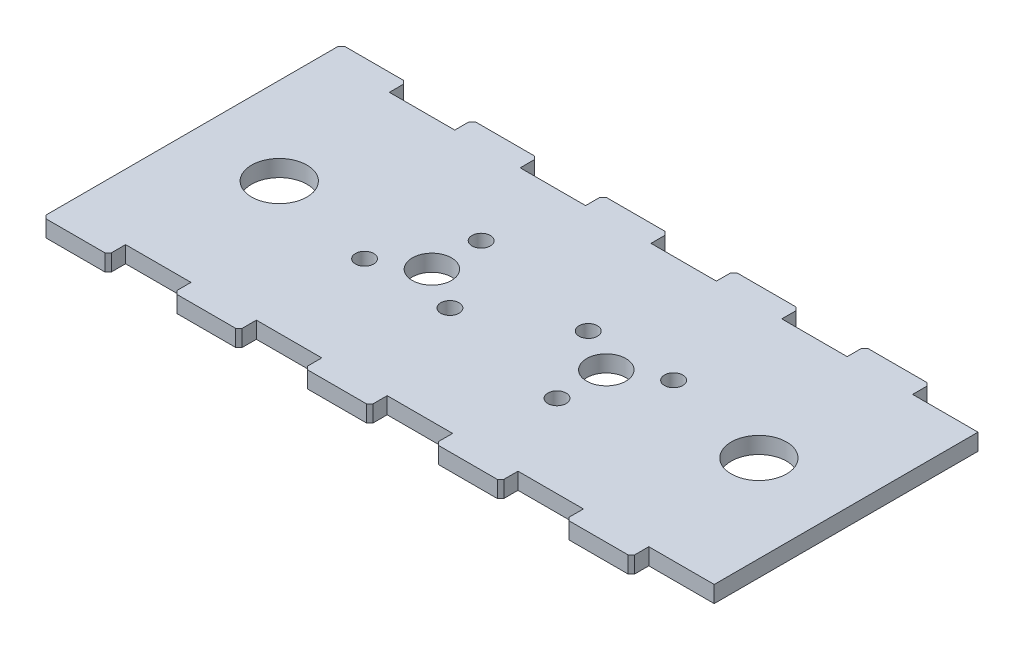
ISO-10303-21;
HEADER;
FILE_DESCRIPTION(('STEP AP214'),'2;1');
FILE_NAME('part.step','',(''),(''),'','','');
FILE_SCHEMA(('AUTOMOTIVE_DESIGN { 1 0 10303 214 1 1 1 1 }'));
ENDSEC;
DATA;
#1=APPLICATION_CONTEXT('core data for automotive mechanical design processes');
#2=APPLICATION_PROTOCOL_DEFINITION('international standard','automotive_design',2000,#1);
#3=PRODUCT_CONTEXT('',#1,'mechanical');
#4=PRODUCT('Part','Part','',(#3));
#5=PRODUCT_RELATED_PRODUCT_CATEGORY('part','',(#4));
#6=PRODUCT_DEFINITION_FORMATION('','',#4);
#7=PRODUCT_DEFINITION_CONTEXT('part definition',#1,'design');
#8=PRODUCT_DEFINITION('design','',#6,#7);
#9=PRODUCT_DEFINITION_SHAPE('','',#8);
#10=(LENGTH_UNIT() NAMED_UNIT(*) SI_UNIT(.MILLI.,.METRE.));
#11=(NAMED_UNIT(*) PLANE_ANGLE_UNIT() SI_UNIT($,.RADIAN.));
#12=(NAMED_UNIT(*) SI_UNIT($,.STERADIAN.) SOLID_ANGLE_UNIT());
#13=UNCERTAINTY_MEASURE_WITH_UNIT(LENGTH_MEASURE(1.E-05),#10,'distance_accuracy_value','');
#14=(GEOMETRIC_REPRESENTATION_CONTEXT(3) GLOBAL_UNCERTAINTY_ASSIGNED_CONTEXT((#13)) GLOBAL_UNIT_ASSIGNED_CONTEXT((#10,
#11,#12)) REPRESENTATION_CONTEXT('',''));
#15=CARTESIAN_POINT('',(0.,0.,0.));
#16=DIRECTION('',(0.,0.,1.));
#17=DIRECTION('',(1.,0.,0.));
#18=AXIS2_PLACEMENT_3D('',#15,#16,#17);
#19=CARTESIAN_POINT('',(0.,3.81,0.));
#20=DIRECTION('',(0.,0.,-1.));
#21=DIRECTION('',(-1.,0.,0.));
#22=AXIS2_PLACEMENT_3D('',#19,#20,#21);
#23=PLANE('',#22);
#24=DIRECTION('',(1.,0.,0.));
#25=VECTOR('',#24,1.);
#26=CARTESIAN_POINT('',(0.,0.,0.));
#27=LINE('',#26,#25);
#28=CARTESIAN_POINT('',(105.,0.,0.));
#29=VERTEX_POINT('',#28);
#30=CARTESIAN_POINT('',(120.,0.,0.));
#31=VERTEX_POINT('',#30);
#32=EDGE_CURVE('E434',#29,#31,#27,.T.);
#33=ORIENTED_EDGE('',*,*,#32,.T.);
#34=DIRECTION('',(0.,1.,0.));
#35=VECTOR('',#34,1.);
#36=CARTESIAN_POINT('',(120.,-15.5241746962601,0.));
#37=LINE('',#36,#35);
#38=CARTESIAN_POINT('',(120.,3.81,0.));
#39=VERTEX_POINT('',#38);
#40=EDGE_CURVE('E441',#31,#39,#37,.T.);
#41=ORIENTED_EDGE('',*,*,#40,.T.);
#42=DIRECTION('',(1.,0.,0.));
#43=VECTOR('',#42,1.);
#44=CARTESIAN_POINT('',(0.,3.81,0.));
#45=LINE('',#44,#43);
#46=CARTESIAN_POINT('',(105.,3.81,0.));
#47=VERTEX_POINT('',#46);
#48=EDGE_CURVE('E864',#47,#39,#45,.T.);
#49=ORIENTED_EDGE('',*,*,#48,.F.);
#50=DIRECTION('',(0.,1.,0.));
#51=VECTOR('',#50,1.);
#52=CARTESIAN_POINT('',(105.,-15.5241746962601,0.));
#53=LINE('',#52,#51);
#54=EDGE_CURVE('E525',#29,#47,#53,.T.);
#55=ORIENTED_EDGE('',*,*,#54,.F.);
#56=EDGE_LOOP('',(#33,#41,#49,#55));
#57=FACE_BOUND('',#56,.T.);
#58=ADVANCED_FACE('F35',(#57),#23,.F.);
#59=CARTESIAN_POINT('',(0.,3.81,-60.5));
#60=DIRECTION('',(0.,0.,1.));
#61=DIRECTION('',(1.,0.,0.));
#62=AXIS2_PLACEMENT_3D('',#59,#60,#61);
#63=PLANE('',#62);
#64=DIRECTION('',(-1.,0.,0.));
#65=VECTOR('',#64,1.);
#66=CARTESIAN_POINT('',(0.,0.,-60.5));
#67=LINE('',#66,#65);
#68=CARTESIAN_POINT('',(150.,0.,-60.5000000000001));
#69=VERTEX_POINT('',#68);
#70=CARTESIAN_POINT('',(135.,0.,-60.5000000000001));
#71=VERTEX_POINT('',#70);
#72=EDGE_CURVE('E872',#69,#71,#67,.T.);
#73=ORIENTED_EDGE('',*,*,#72,.T.);
#74=DIRECTION('',(0.,1.,0.));
#75=VECTOR('',#74,1.);
#76=CARTESIAN_POINT('',(135.,-15.5241746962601,-60.5));
#77=LINE('',#76,#75);
#78=CARTESIAN_POINT('',(135.,3.81,-60.5000000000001));
#79=VERTEX_POINT('',#78);
#80=EDGE_CURVE('E451',#71,#79,#77,.T.);
#81=ORIENTED_EDGE('',*,*,#80,.T.);
#82=DIRECTION('',(-1.,0.,0.));
#83=VECTOR('',#82,1.);
#84=CARTESIAN_POINT('',(0.,3.81,-60.5));
#85=LINE('',#84,#83);
#86=CARTESIAN_POINT('',(150.,3.81,-60.5000000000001));
#87=VERTEX_POINT('',#86);
#88=EDGE_CURVE('E890',#87,#79,#85,.T.);
#89=ORIENTED_EDGE('',*,*,#88,.F.);
#90=DIRECTION('',(0.,-1.,0.));
#91=VECTOR('',#90,1.);
#92=CARTESIAN_POINT('',(150.,3.81,-60.5000000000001));
#93=LINE('',#92,#91);
#94=EDGE_CURVE('E893',#87,#69,#93,.T.);
#95=ORIENTED_EDGE('',*,*,#94,.T.);
#96=EDGE_LOOP('',(#73,#81,#89,#95));
#97=FACE_BOUND('',#96,.T.);
#98=ADVANCED_FACE('F800',(#97),#63,.F.);
#99=CARTESIAN_POINT('',(75.,0.,0.));
#100=VERTEX_POINT('',#99);
#101=CARTESIAN_POINT('',(90.,0.,0.));
#102=VERTEX_POINT('',#101);
#103=EDGE_CURVE('E847',#100,#102,#27,.T.);
#104=ORIENTED_EDGE('',*,*,#103,.T.);
#105=DIRECTION('',(0.,1.,0.));
#106=VECTOR('',#105,1.);
#107=CARTESIAN_POINT('',(90.,-15.5241746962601,0.));
#108=LINE('',#107,#106);
#109=CARTESIAN_POINT('',(90.,3.81,0.));
#110=VERTEX_POINT('',#109);
#111=EDGE_CURVE('E530',#102,#110,#108,.T.);
#112=ORIENTED_EDGE('',*,*,#111,.T.);
#113=CARTESIAN_POINT('',(75.,3.81,0.));
#114=VERTEX_POINT('',#113);
#115=EDGE_CURVE('E862',#114,#110,#45,.T.);
#116=ORIENTED_EDGE('',*,*,#115,.F.);
#117=DIRECTION('',(0.,1.,0.));
#118=VECTOR('',#117,1.);
#119=CARTESIAN_POINT('',(75.,-15.5241746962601,0.));
#120=LINE('',#119,#118);
#121=EDGE_CURVE('E576',#100,#114,#120,.T.);
#122=ORIENTED_EDGE('',*,*,#121,.F.);
#123=EDGE_LOOP('',(#104,#112,#116,#122));
#124=FACE_BOUND('',#123,.T.);
#125=ADVANCED_FACE('F806',(#124),#23,.F.);
#126=CARTESIAN_POINT('',(120.,3.81,-60.5000000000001));
#127=VERTEX_POINT('',#126);
#128=CARTESIAN_POINT('',(105.,3.81,-60.5000000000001));
#129=VERTEX_POINT('',#128);
#130=EDGE_CURVE('E894',#127,#129,#85,.T.);
#131=ORIENTED_EDGE('',*,*,#130,.F.);
#132=DIRECTION('',(0.,1.,0.));
#133=VECTOR('',#132,1.);
#134=CARTESIAN_POINT('',(120.,-15.5241746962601,-60.5));
#135=LINE('',#134,#133);
#136=CARTESIAN_POINT('',(120.,0.,-60.5));
#137=VERTEX_POINT('',#136);
#138=EDGE_CURVE('E465',#137,#127,#135,.T.);
#139=ORIENTED_EDGE('',*,*,#138,.F.);
#140=CARTESIAN_POINT('',(105.,0.,-60.5000000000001));
#141=VERTEX_POINT('',#140);
#142=EDGE_CURVE('E874',#137,#141,#67,.T.);
#143=ORIENTED_EDGE('',*,*,#142,.T.);
#144=DIRECTION('',(0.,1.,0.));
#145=VECTOR('',#144,1.);
#146=CARTESIAN_POINT('',(105.,-15.5241746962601,-60.5));
#147=LINE('',#146,#145);
#148=EDGE_CURVE('E537',#141,#129,#147,.T.);
#149=ORIENTED_EDGE('',*,*,#148,.T.);
#150=EDGE_LOOP('',(#131,#139,#143,#149));
#151=FACE_BOUND('',#150,.T.);
#152=ADVANCED_FACE('F811',(#151),#63,.F.);
#153=CARTESIAN_POINT('',(45.,0.,0.));
#154=VERTEX_POINT('',#153);
#155=CARTESIAN_POINT('',(60.,0.,0.));
#156=VERTEX_POINT('',#155);
#157=EDGE_CURVE('E841',#154,#156,#27,.T.);
#158=ORIENTED_EDGE('',*,*,#157,.T.);
#159=DIRECTION('',(0.,1.,0.));
#160=VECTOR('',#159,1.);
#161=CARTESIAN_POINT('',(60.,-15.5241746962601,0.));
#162=LINE('',#161,#160);
#163=CARTESIAN_POINT('',(60.,3.81,0.));
#164=VERTEX_POINT('',#163);
#165=EDGE_CURVE('E581',#156,#164,#162,.T.);
#166=ORIENTED_EDGE('',*,*,#165,.T.);
#167=CARTESIAN_POINT('',(45.,3.81,0.));
#168=VERTEX_POINT('',#167);
#169=EDGE_CURVE('E497',#168,#164,#45,.T.);
#170=ORIENTED_EDGE('',*,*,#169,.F.);
#171=DIRECTION('',(0.,1.,0.));
#172=VECTOR('',#171,1.);
#173=CARTESIAN_POINT('',(45.,-15.5241746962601,0.));
#174=LINE('',#173,#172);
#175=EDGE_CURVE('E628',#154,#168,#174,.T.);
#176=ORIENTED_EDGE('',*,*,#175,.F.);
#177=EDGE_LOOP('',(#158,#166,#170,#176));
#178=FACE_BOUND('',#177,.T.);
#179=ADVANCED_FACE('F816',(#178),#23,.F.);
#180=CARTESIAN_POINT('',(90.,3.81,-60.5000000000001));
#181=VERTEX_POINT('',#180);
#182=CARTESIAN_POINT('',(75.,3.81,-60.5));
#183=VERTEX_POINT('',#182);
#184=EDGE_CURVE('E1107',#181,#183,#85,.T.);
#185=ORIENTED_EDGE('',*,*,#184,.F.);
#186=DIRECTION('',(0.,1.,0.));
#187=VECTOR('',#186,1.);
#188=CARTESIAN_POINT('',(90.,-15.5241746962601,-60.5));
#189=LINE('',#188,#187);
#190=CARTESIAN_POINT('',(90.,0.,-60.5));
#191=VERTEX_POINT('',#190);
#192=EDGE_CURVE('E549',#191,#181,#189,.T.);
#193=ORIENTED_EDGE('',*,*,#192,.F.);
#194=CARTESIAN_POINT('',(75.,0.,-60.5));
#195=VERTEX_POINT('',#194);
#196=EDGE_CURVE('E879',#191,#195,#67,.T.);
#197=ORIENTED_EDGE('',*,*,#196,.T.);
#198=DIRECTION('',(0.,1.,0.));
#199=VECTOR('',#198,1.);
#200=CARTESIAN_POINT('',(75.,-15.5241746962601,-60.5));
#201=LINE('',#200,#199);
#202=EDGE_CURVE('E588',#195,#183,#201,.T.);
#203=ORIENTED_EDGE('',*,*,#202,.T.);
#204=EDGE_LOOP('',(#185,#193,#197,#203));
#205=FACE_BOUND('',#204,.T.);
#206=ADVANCED_FACE('F826',(#205),#63,.F.);
#207=CARTESIAN_POINT('',(15.,0.,0.));
#208=VERTEX_POINT('',#207);
#209=CARTESIAN_POINT('',(30.,0.,0.));
#210=VERTEX_POINT('',#209);
#211=EDGE_CURVE('E437',#208,#210,#27,.T.);
#212=ORIENTED_EDGE('',*,*,#211,.T.);
#213=DIRECTION('',(0.,1.,0.));
#214=VECTOR('',#213,1.);
#215=CARTESIAN_POINT('',(30.,-15.5241746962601,0.));
#216=LINE('',#215,#214);
#217=CARTESIAN_POINT('',(30.,3.81,0.));
#218=VERTEX_POINT('',#217);
#219=EDGE_CURVE('E633',#210,#218,#216,.T.);
#220=ORIENTED_EDGE('',*,*,#219,.T.);
#221=CARTESIAN_POINT('',(15.,3.81,0.));
#222=VERTEX_POINT('',#221);
#223=EDGE_CURVE('E491',#222,#218,#45,.T.);
#224=ORIENTED_EDGE('',*,*,#223,.F.);
#225=DIRECTION('',(0.,1.,0.));
#226=VECTOR('',#225,1.);
#227=CARTESIAN_POINT('',(15.,-15.5241746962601,0.));
#228=LINE('',#227,#226);
#229=EDGE_CURVE('E695',#208,#222,#228,.T.);
#230=ORIENTED_EDGE('',*,*,#229,.F.);
#231=EDGE_LOOP('',(#212,#220,#224,#230));
#232=FACE_BOUND('',#231,.T.);
#233=ADVANCED_FACE('F819',(#232),#23,.F.);
#234=CARTESIAN_POINT('',(60.,3.81,-60.5));
#235=VERTEX_POINT('',#234);
#236=CARTESIAN_POINT('',(45.,3.81,-60.5));
#237=VERTEX_POINT('',#236);
#238=EDGE_CURVE('E1104',#235,#237,#85,.T.);
#239=ORIENTED_EDGE('',*,*,#238,.F.);
#240=DIRECTION('',(0.,1.,0.));
#241=VECTOR('',#240,1.);
#242=CARTESIAN_POINT('',(60.,-15.5241746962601,-60.5));
#243=LINE('',#242,#241);
#244=CARTESIAN_POINT('',(60.,0.,-60.5));
#245=VERTEX_POINT('',#244);
#246=EDGE_CURVE('E600',#245,#235,#243,.T.);
#247=ORIENTED_EDGE('',*,*,#246,.F.);
#248=CARTESIAN_POINT('',(45.,0.,-60.5));
#249=VERTEX_POINT('',#248);
#250=EDGE_CURVE('E882',#245,#249,#67,.T.);
#251=ORIENTED_EDGE('',*,*,#250,.T.);
#252=DIRECTION('',(0.,1.,0.));
#253=VECTOR('',#252,1.);
#254=CARTESIAN_POINT('',(45.,-15.5241746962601,-60.5));
#255=LINE('',#254,#253);
#256=EDGE_CURVE('E640',#249,#237,#255,.T.);
#257=ORIENTED_EDGE('',*,*,#256,.T.);
#258=EDGE_LOOP('',(#239,#247,#251,#257));
#259=FACE_BOUND('',#258,.T.);
#260=ADVANCED_FACE('F801',(#259),#63,.F.);
#261=CARTESIAN_POINT('',(135.,3.81,0.));
#262=VERTEX_POINT('',#261);
#263=CARTESIAN_POINT('',(150.,3.81,0.));
#264=VERTEX_POINT('',#263);
#265=EDGE_CURVE('E440',#262,#264,#45,.T.);
#266=ORIENTED_EDGE('',*,*,#265,.F.);
#267=DIRECTION('',(0.,1.,0.));
#268=VECTOR('',#267,1.);
#269=CARTESIAN_POINT('',(135.,-15.5241746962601,0.));
#270=LINE('',#269,#268);
#271=CARTESIAN_POINT('',(135.,0.,0.));
#272=VERTEX_POINT('',#271);
#273=EDGE_CURVE('E418',#272,#262,#270,.T.);
#274=ORIENTED_EDGE('',*,*,#273,.F.);
#275=CARTESIAN_POINT('',(150.,0.,0.));
#276=VERTEX_POINT('',#275);
#277=EDGE_CURVE('E425',#272,#276,#27,.T.);
#278=ORIENTED_EDGE('',*,*,#277,.T.);
#279=DIRECTION('',(0.,-1.,0.));
#280=VECTOR('',#279,1.);
#281=CARTESIAN_POINT('',(150.,3.81,0.));
#282=LINE('',#281,#280);
#283=EDGE_CURVE('E1095',#264,#276,#282,.T.);
#284=ORIENTED_EDGE('',*,*,#283,.F.);
#285=EDGE_LOOP('',(#266,#274,#278,#284));
#286=FACE_BOUND('',#285,.T.);
#287=ADVANCED_FACE('F439',(#286),#23,.F.);
#288=CARTESIAN_POINT('',(0.,3.81,0.));
#289=DIRECTION('',(0.,-1.,0.));
#290=DIRECTION('',(0.,0.,-1.));
#291=AXIS2_PLACEMENT_3D('',#288,#289,#290);
#292=PLANE('',#291);
#293=DIRECTION('',(0.,0.,-1.));
#294=VECTOR('',#293,1.);
#295=CARTESIAN_POINT('',(135.,3.81,-60.5));
#296=LINE('',#295,#294);
#297=CARTESIAN_POINT('',(135.,3.81,-63.75));
#298=VERTEX_POINT('',#297);
#299=EDGE_CURVE('E452',#79,#298,#296,.T.);
#300=ORIENTED_EDGE('',*,*,#299,.T.);
#301=DIRECTION('',(0.707106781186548,0.,0.707106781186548));
#302=VECTOR('',#301,1.);
#303=CARTESIAN_POINT('',(135.,3.81,-63.75));
#304=LINE('',#303,#302);
#305=CARTESIAN_POINT('',(134.25,3.81,-64.5));
#306=VERTEX_POINT('',#305);
#307=EDGE_CURVE('E1133',#298,#306,#304,.F.);
#308=ORIENTED_EDGE('',*,*,#307,.T.);
#309=DIRECTION('',(-1.,0.,0.));
#310=VECTOR('',#309,1.);
#311=CARTESIAN_POINT('',(120.,3.81,-64.5));
#312=LINE('',#311,#310);
#313=CARTESIAN_POINT('',(120.75,3.81,-64.5));
#314=VERTEX_POINT('',#313);
#315=EDGE_CURVE('E447',#306,#314,#312,.T.);
#316=ORIENTED_EDGE('',*,*,#315,.T.);
#317=DIRECTION('',(0.707106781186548,0.,-0.707106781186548));
#318=VECTOR('',#317,1.);
#319=CARTESIAN_POINT('',(120.75,3.81,-64.5));
#320=LINE('',#319,#318);
#321=CARTESIAN_POINT('',(120.,3.81,-63.75));
#322=VERTEX_POINT('',#321);
#323=EDGE_CURVE('E1130',#314,#322,#320,.F.);
#324=ORIENTED_EDGE('',*,*,#323,.T.);
#325=DIRECTION('',(0.,0.,1.));
#326=VECTOR('',#325,1.);
#327=CARTESIAN_POINT('',(120.,3.81,-60.5));
#328=LINE('',#327,#326);
#329=EDGE_CURVE('E443',#322,#127,#328,.T.);
#330=ORIENTED_EDGE('',*,*,#329,.T.);
#331=ORIENTED_EDGE('',*,*,#130,.T.);
#332=DIRECTION('',(0.,0.,-1.));
#333=VECTOR('',#332,1.);
#334=CARTESIAN_POINT('',(105.,3.81,-60.5));
#335=LINE('',#334,#333);
#336=CARTESIAN_POINT('',(105.,3.81,-63.75));
#337=VERTEX_POINT('',#336);
#338=EDGE_CURVE('E538',#129,#337,#335,.T.);
#339=ORIENTED_EDGE('',*,*,#338,.T.);
#340=DIRECTION('',(0.707106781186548,0.,0.707106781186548));
#341=VECTOR('',#340,1.);
#342=CARTESIAN_POINT('',(105.,3.81,-63.75));
#343=LINE('',#342,#341);
#344=CARTESIAN_POINT('',(104.25,3.81,-64.5));
#345=VERTEX_POINT('',#344);
#346=EDGE_CURVE('E1128',#337,#345,#343,.F.);
#347=ORIENTED_EDGE('',*,*,#346,.T.);
#348=DIRECTION('',(-1.,0.,0.));
#349=VECTOR('',#348,1.);
#350=CARTESIAN_POINT('',(90.,3.81,-64.5));
#351=LINE('',#350,#349);
#352=CARTESIAN_POINT('',(90.75,3.81,-64.5));
#353=VERTEX_POINT('',#352);
#354=EDGE_CURVE('E533',#345,#353,#351,.T.);
#355=ORIENTED_EDGE('',*,*,#354,.T.);
#356=DIRECTION('',(0.707106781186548,0.,-0.707106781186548));
#357=VECTOR('',#356,1.);
#358=CARTESIAN_POINT('',(90.75,3.81,-64.5));
#359=LINE('',#358,#357);
#360=CARTESIAN_POINT('',(90.,3.81,-63.75));
#361=VERTEX_POINT('',#360);
#362=EDGE_CURVE('E1131',#353,#361,#359,.F.);
#363=ORIENTED_EDGE('',*,*,#362,.T.);
#364=DIRECTION('',(0.,0.,1.));
#365=VECTOR('',#364,1.);
#366=CARTESIAN_POINT('',(90.,3.81,-60.5));
#367=LINE('',#366,#365);
#368=EDGE_CURVE('E532',#361,#181,#367,.T.);
#369=ORIENTED_EDGE('',*,*,#368,.T.);
#370=ORIENTED_EDGE('',*,*,#184,.T.);
#371=DIRECTION('',(0.,0.,-1.));
#372=VECTOR('',#371,1.);
#373=CARTESIAN_POINT('',(75.,3.81,-60.5));
#374=LINE('',#373,#372);
#375=CARTESIAN_POINT('',(75.,3.81,-63.75));
#376=VERTEX_POINT('',#375);
#377=EDGE_CURVE('E589',#183,#376,#374,.T.);
#378=ORIENTED_EDGE('',*,*,#377,.T.);
#379=DIRECTION('',(0.707106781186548,0.,0.707106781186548));
#380=VECTOR('',#379,1.);
#381=CARTESIAN_POINT('',(75.,3.81,-63.75));
#382=LINE('',#381,#380);
#383=CARTESIAN_POINT('',(74.25,3.81,-64.5));
#384=VERTEX_POINT('',#383);
#385=EDGE_CURVE('E1135',#376,#384,#382,.F.);
#386=ORIENTED_EDGE('',*,*,#385,.T.);
#387=DIRECTION('',(-1.,0.,0.));
#388=VECTOR('',#387,1.);
#389=CARTESIAN_POINT('',(60.,3.81,-64.5));
#390=LINE('',#389,#388);
#391=CARTESIAN_POINT('',(60.75,3.81,-64.5));
#392=VERTEX_POINT('',#391);
#393=EDGE_CURVE('E584',#384,#392,#390,.T.);
#394=ORIENTED_EDGE('',*,*,#393,.T.);
#395=DIRECTION('',(0.707106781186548,0.,-0.707106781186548));
#396=VECTOR('',#395,1.);
#397=CARTESIAN_POINT('',(60.75,3.81,-64.5));
#398=LINE('',#397,#396);
#399=CARTESIAN_POINT('',(60.,3.81,-63.75));
#400=VERTEX_POINT('',#399);
#401=EDGE_CURVE('E1249',#392,#400,#398,.F.);
#402=ORIENTED_EDGE('',*,*,#401,.T.);
#403=DIRECTION('',(0.,0.,1.));
#404=VECTOR('',#403,1.);
#405=CARTESIAN_POINT('',(60.,3.81,-60.5));
#406=LINE('',#405,#404);
#407=EDGE_CURVE('E583',#400,#235,#406,.T.);
#408=ORIENTED_EDGE('',*,*,#407,.T.);
#409=ORIENTED_EDGE('',*,*,#238,.T.);
#410=DIRECTION('',(0.,0.,-1.));
#411=VECTOR('',#410,1.);
#412=CARTESIAN_POINT('',(45.,3.81,-60.5));
#413=LINE('',#412,#411);
#414=CARTESIAN_POINT('',(45.,3.81,-63.75));
#415=VERTEX_POINT('',#414);
#416=EDGE_CURVE('E641',#237,#415,#413,.T.);
#417=ORIENTED_EDGE('',*,*,#416,.T.);
#418=DIRECTION('',(0.707106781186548,0.,0.707106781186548));
#419=VECTOR('',#418,1.);
#420=CARTESIAN_POINT('',(45.,3.81,-63.75));
#421=LINE('',#420,#419);
#422=CARTESIAN_POINT('',(44.25,3.81,-64.5));
#423=VERTEX_POINT('',#422);
#424=EDGE_CURVE('E1247',#415,#423,#421,.F.);
#425=ORIENTED_EDGE('',*,*,#424,.T.);
#426=DIRECTION('',(-1.,0.,0.));
#427=VECTOR('',#426,1.);
#428=CARTESIAN_POINT('',(30.,3.81,-64.5));
#429=LINE('',#428,#427);
#430=CARTESIAN_POINT('',(30.75,3.81,-64.5));
#431=VERTEX_POINT('',#430);
#432=EDGE_CURVE('E636',#423,#431,#429,.T.);
#433=ORIENTED_EDGE('',*,*,#432,.T.);
#434=DIRECTION('',(0.707106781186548,0.,-0.707106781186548));
#435=VECTOR('',#434,1.);
#436=CARTESIAN_POINT('',(30.75,3.81,-64.5));
#437=LINE('',#436,#435);
#438=CARTESIAN_POINT('',(30.,3.81,-63.75));
#439=VERTEX_POINT('',#438);
#440=EDGE_CURVE('E1246',#431,#439,#437,.F.);
#441=ORIENTED_EDGE('',*,*,#440,.T.);
#442=DIRECTION('',(0.,0.,1.));
#443=VECTOR('',#442,1.);
#444=CARTESIAN_POINT('',(30.,3.81,-60.5));
#445=LINE('',#444,#443);
#446=CARTESIAN_POINT('',(30.,3.81,-60.5));
#447=VERTEX_POINT('',#446);
#448=EDGE_CURVE('E635',#439,#447,#445,.T.);
#449=ORIENTED_EDGE('',*,*,#448,.T.);
#450=CARTESIAN_POINT('',(15.,3.81,-60.5));
#451=VERTEX_POINT('',#450);
#452=EDGE_CURVE('E895',#447,#451,#85,.T.);
#453=ORIENTED_EDGE('',*,*,#452,.T.);
#454=DIRECTION('',(0.,0.,-1.));
#455=VECTOR('',#454,1.);
#456=CARTESIAN_POINT('',(15.,3.81,-60.5));
#457=LINE('',#456,#455);
#458=CARTESIAN_POINT('',(15.,3.81,-63.75));
#459=VERTEX_POINT('',#458);
#460=EDGE_CURVE('E694',#451,#459,#457,.T.);
#461=ORIENTED_EDGE('',*,*,#460,.T.);
#462=DIRECTION('',(0.707106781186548,0.,0.707106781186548));
#463=VECTOR('',#462,1.);
#464=CARTESIAN_POINT('',(15.,3.81,-63.75));
#465=LINE('',#464,#463);
#466=CARTESIAN_POINT('',(14.25,3.81,-64.5));
#467=VERTEX_POINT('',#466);
#468=EDGE_CURVE('E684',#459,#467,#465,.F.);
#469=ORIENTED_EDGE('',*,*,#468,.T.);
#470=DIRECTION('',(-1.,0.,0.));
#471=VECTOR('',#470,1.);
#472=CARTESIAN_POINT('',(0.,3.81,-64.5));
#473=LINE('',#472,#471);
#474=CARTESIAN_POINT('',(0.750000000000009,3.81,-64.5));
#475=VERTEX_POINT('',#474);
#476=EDGE_CURVE('E689',#467,#475,#473,.T.);
#477=ORIENTED_EDGE('',*,*,#476,.T.);
#478=DIRECTION('',(-0.707106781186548,0.,0.707106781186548));
#479=VECTOR('',#478,1.);
#480=CARTESIAN_POINT('',(0.750000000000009,3.81,-64.5));
#481=LINE('',#480,#479);
#482=CARTESIAN_POINT('',(0.,3.81,-63.75));
#483=VERTEX_POINT('',#482);
#484=EDGE_CURVE('E679',#475,#483,#481,.T.);
#485=ORIENTED_EDGE('',*,*,#484,.T.);
#486=DIRECTION('',(0.,0.,1.));
#487=VECTOR('',#486,1.);
#488=CARTESIAN_POINT('',(0.,3.81,0.));
#489=LINE('',#488,#487);
#490=CARTESIAN_POINT('',(0.,3.81,3.25000000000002));
#491=VERTEX_POINT('',#490);
#492=EDGE_CURVE('E498',#483,#491,#489,.T.);
#493=ORIENTED_EDGE('',*,*,#492,.T.);
#494=DIRECTION('',(0.707106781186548,0.,0.707106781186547));
#495=VECTOR('',#494,1.);
#496=CARTESIAN_POINT('',(0.,3.81,3.25000000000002));
#497=LINE('',#496,#495);
#498=CARTESIAN_POINT('',(0.749999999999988,3.81,4.));
#499=VERTEX_POINT('',#498);
#500=EDGE_CURVE('E675',#491,#499,#497,.T.);
#501=ORIENTED_EDGE('',*,*,#500,.T.);
#502=DIRECTION('',(1.,0.,0.));
#503=VECTOR('',#502,1.);
#504=CARTESIAN_POINT('',(0.,3.81,4.));
#505=LINE('',#504,#503);
#506=CARTESIAN_POINT('',(14.25,3.81,4.));
#507=VERTEX_POINT('',#506);
#508=EDGE_CURVE('E663',#499,#507,#505,.T.);
#509=ORIENTED_EDGE('',*,*,#508,.T.);
#510=DIRECTION('',(-0.707106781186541,0.,0.707106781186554));
#511=VECTOR('',#510,1.);
#512=CARTESIAN_POINT('',(14.25,3.81,4.));
#513=LINE('',#512,#511);
#514=CARTESIAN_POINT('',(15.,3.81,3.25));
#515=VERTEX_POINT('',#514);
#516=EDGE_CURVE('E1090',#507,#515,#513,.F.);
#517=ORIENTED_EDGE('',*,*,#516,.T.);
#518=DIRECTION('',(0.,0.,-1.));
#519=VECTOR('',#518,1.);
#520=CARTESIAN_POINT('',(15.,3.81,0.));
#521=LINE('',#520,#519);
#522=EDGE_CURVE('E664',#515,#222,#521,.T.);
#523=ORIENTED_EDGE('',*,*,#522,.T.);
#524=ORIENTED_EDGE('',*,*,#223,.T.);
#525=DIRECTION('',(0.,0.,1.));
#526=VECTOR('',#525,1.);
#527=CARTESIAN_POINT('',(30.,3.81,0.));
#528=LINE('',#527,#526);
#529=CARTESIAN_POINT('',(30.,3.81,3.25000000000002));
#530=VERTEX_POINT('',#529);
#531=EDGE_CURVE('E611',#218,#530,#528,.T.);
#532=ORIENTED_EDGE('',*,*,#531,.T.);
#533=DIRECTION('',(-0.707106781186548,0.,-0.707106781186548));
#534=VECTOR('',#533,1.);
#535=CARTESIAN_POINT('',(30.,3.81,3.25000000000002));
#536=LINE('',#535,#534);
#537=CARTESIAN_POINT('',(30.75,3.81,4.));
#538=VERTEX_POINT('',#537);
#539=EDGE_CURVE('E680',#530,#538,#536,.F.);
#540=ORIENTED_EDGE('',*,*,#539,.T.);
#541=DIRECTION('',(1.,0.,0.));
#542=VECTOR('',#541,1.);
#543=CARTESIAN_POINT('',(30.,3.81,4.));
#544=LINE('',#543,#542);
#545=CARTESIAN_POINT('',(44.25,3.81,4.));
#546=VERTEX_POINT('',#545);
#547=EDGE_CURVE('E616',#538,#546,#544,.T.);
#548=ORIENTED_EDGE('',*,*,#547,.T.);
#549=DIRECTION('',(-0.707106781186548,0.,0.707106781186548));
#550=VECTOR('',#549,1.);
#551=CARTESIAN_POINT('',(44.25,3.81,4.));
#552=LINE('',#551,#550);
#553=CARTESIAN_POINT('',(45.,3.81,3.25));
#554=VERTEX_POINT('',#553);
#555=EDGE_CURVE('E1088',#546,#554,#552,.F.);
#556=ORIENTED_EDGE('',*,*,#555,.T.);
#557=DIRECTION('',(0.,0.,-1.));
#558=VECTOR('',#557,1.);
#559=CARTESIAN_POINT('',(45.,3.81,0.));
#560=LINE('',#559,#558);
#561=EDGE_CURVE('E612',#554,#168,#560,.T.);
#562=ORIENTED_EDGE('',*,*,#561,.T.);
#563=ORIENTED_EDGE('',*,*,#169,.T.);
#564=DIRECTION('',(0.,0.,1.));
#565=VECTOR('',#564,1.);
#566=CARTESIAN_POINT('',(60.,3.81,0.));
#567=LINE('',#566,#565);
#568=CARTESIAN_POINT('',(60.,3.81,3.24999999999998));
#569=VERTEX_POINT('',#568);
#570=EDGE_CURVE('E559',#164,#569,#567,.T.);
#571=ORIENTED_EDGE('',*,*,#570,.T.);
#572=DIRECTION('',(-0.707106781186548,0.,-0.707106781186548));
#573=VECTOR('',#572,1.);
#574=CARTESIAN_POINT('',(60.,3.81,3.24999999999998));
#575=LINE('',#574,#573);
#576=CARTESIAN_POINT('',(60.75,3.81,4.));
#577=VERTEX_POINT('',#576);
#578=EDGE_CURVE('E859',#569,#577,#575,.F.);
#579=ORIENTED_EDGE('',*,*,#578,.T.);
#580=DIRECTION('',(1.,0.,0.));
#581=VECTOR('',#580,1.);
#582=CARTESIAN_POINT('',(60.,3.81,4.));
#583=LINE('',#582,#581);
#584=CARTESIAN_POINT('',(74.25,3.81,4.));
#585=VERTEX_POINT('',#584);
#586=EDGE_CURVE('E564',#577,#585,#583,.T.);
#587=ORIENTED_EDGE('',*,*,#586,.T.);
#588=DIRECTION('',(-0.707106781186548,0.,0.707106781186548));
#589=VECTOR('',#588,1.);
#590=CARTESIAN_POINT('',(74.25,3.81,4.));
#591=LINE('',#590,#589);
#592=CARTESIAN_POINT('',(75.,3.81,3.25));
#593=VERTEX_POINT('',#592);
#594=EDGE_CURVE('E1086',#585,#593,#591,.F.);
#595=ORIENTED_EDGE('',*,*,#594,.T.);
#596=DIRECTION('',(0.,0.,-1.));
#597=VECTOR('',#596,1.);
#598=CARTESIAN_POINT('',(75.,3.81,0.));
#599=LINE('',#598,#597);
#600=EDGE_CURVE('E560',#593,#114,#599,.T.);
#601=ORIENTED_EDGE('',*,*,#600,.T.);
#602=ORIENTED_EDGE('',*,*,#115,.T.);
#603=DIRECTION('',(0.,0.,1.));
#604=VECTOR('',#603,1.);
#605=CARTESIAN_POINT('',(90.,3.81,0.));
#606=LINE('',#605,#604);
#607=CARTESIAN_POINT('',(90.,3.81,3.25000000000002));
#608=VERTEX_POINT('',#607);
#609=EDGE_CURVE('E475',#110,#608,#606,.T.);
#610=ORIENTED_EDGE('',*,*,#609,.T.);
#611=DIRECTION('',(-0.707106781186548,0.,-0.707106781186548));
#612=VECTOR('',#611,1.);
#613=CARTESIAN_POINT('',(90.,3.81,3.25000000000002));
#614=LINE('',#613,#612);
#615=CARTESIAN_POINT('',(90.75,3.81,4.));
#616=VERTEX_POINT('',#615);
#617=EDGE_CURVE('E1075',#608,#616,#614,.F.);
#618=ORIENTED_EDGE('',*,*,#617,.T.);
#619=DIRECTION('',(1.,0.,0.));
#620=VECTOR('',#619,1.);
#621=CARTESIAN_POINT('',(90.,3.81,4.));
#622=LINE('',#621,#620);
#623=CARTESIAN_POINT('',(104.25,3.81,4.));
#624=VERTEX_POINT('',#623);
#625=EDGE_CURVE('E480',#616,#624,#622,.T.);
#626=ORIENTED_EDGE('',*,*,#625,.T.);
#627=DIRECTION('',(-0.707106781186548,0.,0.707106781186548));
#628=VECTOR('',#627,1.);
#629=CARTESIAN_POINT('',(104.25,3.81,4.));
#630=LINE('',#629,#628);
#631=CARTESIAN_POINT('',(105.,3.81,3.25));
#632=VERTEX_POINT('',#631);
#633=EDGE_CURVE('E1084',#624,#632,#630,.F.);
#634=ORIENTED_EDGE('',*,*,#633,.T.);
#635=DIRECTION('',(0.,0.,-1.));
#636=VECTOR('',#635,1.);
#637=CARTESIAN_POINT('',(105.,3.81,0.));
#638=LINE('',#637,#636);
#639=EDGE_CURVE('E476',#632,#47,#638,.T.);
#640=ORIENTED_EDGE('',*,*,#639,.T.);
#641=ORIENTED_EDGE('',*,*,#48,.T.);
#642=DIRECTION('',(0.,0.,1.));
#643=VECTOR('',#642,1.);
#644=CARTESIAN_POINT('',(120.,3.81,0.));
#645=LINE('',#644,#643);
#646=CARTESIAN_POINT('',(120.,3.81,3.24999999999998));
#647=VERTEX_POINT('',#646);
#648=EDGE_CURVE('E910',#39,#647,#645,.T.);
#649=ORIENTED_EDGE('',*,*,#648,.T.);
#650=DIRECTION('',(-0.707106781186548,0.,-0.707106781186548));
#651=VECTOR('',#650,1.);
#652=CARTESIAN_POINT('',(120.,3.81,3.24999999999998));
#653=LINE('',#652,#651);
#654=CARTESIAN_POINT('',(120.75,3.81,4.));
#655=VERTEX_POINT('',#654);
#656=EDGE_CURVE('E1079',#647,#655,#653,.F.);
#657=ORIENTED_EDGE('',*,*,#656,.T.);
#658=DIRECTION('',(1.,0.,0.));
#659=VECTOR('',#658,1.);
#660=CARTESIAN_POINT('',(120.,3.81,4.));
#661=LINE('',#660,#659);
#662=CARTESIAN_POINT('',(134.25,3.81,4.));
#663=VERTEX_POINT('',#662);
#664=EDGE_CURVE('E907',#655,#663,#661,.T.);
#665=ORIENTED_EDGE('',*,*,#664,.T.);
#666=DIRECTION('',(-0.707106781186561,0.,0.707106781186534));
#667=VECTOR('',#666,1.);
#668=CARTESIAN_POINT('',(134.25,3.81,4.));
#669=LINE('',#668,#667);
#670=CARTESIAN_POINT('',(135.,3.81,3.25));
#671=VERTEX_POINT('',#670);
#672=EDGE_CURVE('E933',#663,#671,#669,.F.);
#673=ORIENTED_EDGE('',*,*,#672,.T.);
#674=DIRECTION('',(0.,0.,-1.));
#675=VECTOR('',#674,1.);
#676=CARTESIAN_POINT('',(135.,3.81,0.));
#677=LINE('',#676,#675);
#678=EDGE_CURVE('E904',#671,#262,#677,.T.);
#679=ORIENTED_EDGE('',*,*,#678,.T.);
#680=ORIENTED_EDGE('',*,*,#265,.T.);
#681=DIRECTION('',(0.,0.,-1.));
#682=VECTOR('',#681,1.);
#683=CARTESIAN_POINT('',(150.,3.81,0.));
#684=LINE('',#683,#682);
#685=EDGE_CURVE('E496',#264,#87,#684,.T.);
#686=ORIENTED_EDGE('',*,*,#685,.T.);
#687=ORIENTED_EDGE('',*,*,#88,.T.);
#688=EDGE_LOOP('',(#300,#308,#316,#324,#330,#331,#339,#347,#355,#363,#369,#370,#378,#386,#394,
#402,#408,#409,#417,#425,#433,#441,#449,#453,#461,#469,#477,#485,#493,#501,#509,#517,#523,#524,
#532,#540,#548,#556,#562,#563,#571,#579,#587,#595,#601,#602,#610,#618,#626,#634,#640,#641,#649,
#657,#665,#673,#679,#680,#686,#687));
#689=FACE_BOUND('',#688,.T.);
#690=CARTESIAN_POINT('',(55.,3.81,-30.25));
#691=DIRECTION('',(0.,1.,0.));
#692=DIRECTION('',(0.,0.,1.));
#693=AXIS2_PLACEMENT_3D('',#690,#691,#692);
#694=CIRCLE('',#693,4.5);
#695=CARTESIAN_POINT('',(55.,3.81,-25.75));
#696=VERTEX_POINT('',#695);
#697=EDGE_CURVE('E777',#696,#696,#694,.T.);
#698=ORIENTED_EDGE('',*,*,#697,.F.);
#699=EDGE_LOOP('',(#698));
#700=FACE_BOUND('',#699,.T.);
#701=CARTESIAN_POINT('',(55.,3.81,-41.55));
#702=DIRECTION('',(0.,1.,0.));
#703=DIRECTION('',(0.,0.,1.));
#704=AXIS2_PLACEMENT_3D('',#701,#702,#703);
#705=CIRCLE('',#704,2.1);
#706=CARTESIAN_POINT('',(55.,3.81,-39.45));
#707=VERTEX_POINT('',#706);
#708=EDGE_CURVE('E771',#707,#707,#705,.T.);
#709=ORIENTED_EDGE('',*,*,#708,.F.);
#710=EDGE_LOOP('',(#709));
#711=FACE_BOUND('',#710,.T.);
#712=CARTESIAN_POINT('',(95.,3.81,-30.25));
#713=DIRECTION('',(0.,1.,0.));
#714=DIRECTION('',(0.,0.,1.));
#715=AXIS2_PLACEMENT_3D('',#712,#713,#714);
#716=CIRCLE('',#715,4.50000000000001);
#717=CARTESIAN_POINT('',(95.,3.81,-25.75));
#718=VERTEX_POINT('',#717);
#719=EDGE_CURVE('E761',#718,#718,#716,.T.);
#720=ORIENTED_EDGE('',*,*,#719,.F.);
#721=EDGE_LOOP('',(#720));
#722=FACE_BOUND('',#721,.T.);
#723=CARTESIAN_POINT('',(64.7860870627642,3.81,-24.6));
#724=DIRECTION('',(0.,1.,0.));
#725=DIRECTION('',(0.,0.,1.));
#726=AXIS2_PLACEMENT_3D('',#723,#724,#725);
#727=CIRCLE('',#726,2.09999999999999);
#728=CARTESIAN_POINT('',(64.7860870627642,3.81,-22.5));
#729=VERTEX_POINT('',#728);
#730=EDGE_CURVE('E754',#729,#729,#727,.T.);
#731=ORIENTED_EDGE('',*,*,#730,.F.);
#732=EDGE_LOOP('',(#731));
#733=FACE_BOUND('',#732,.T.);
#734=CARTESIAN_POINT('',(45.2139129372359,3.81,-24.6));
#735=DIRECTION('',(0.,1.,0.));
#736=DIRECTION('',(0.,0.,1.));
#737=AXIS2_PLACEMENT_3D('',#734,#735,#736);
#738=CIRCLE('',#737,2.1);
#739=CARTESIAN_POINT('',(45.2139129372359,3.81,-22.5));
#740=VERTEX_POINT('',#739);
#741=EDGE_CURVE('E748',#740,#740,#738,.T.);
#742=ORIENTED_EDGE('',*,*,#741,.F.);
#743=EDGE_LOOP('',(#742));
#744=FACE_BOUND('',#743,.T.);
#745=CARTESIAN_POINT('',(95.,3.81,-18.95));
#746=DIRECTION('',(0.,1.,0.));
#747=DIRECTION('',(0.,0.,1.));
#748=AXIS2_PLACEMENT_3D('',#745,#746,#747);
#749=CIRCLE('',#748,2.1);
#750=CARTESIAN_POINT('',(95.,3.81,-16.85));
#751=VERTEX_POINT('',#750);
#752=EDGE_CURVE('E738',#751,#751,#749,.T.);
#753=ORIENTED_EDGE('',*,*,#752,.F.);
#754=EDGE_LOOP('',(#753));
#755=FACE_BOUND('',#754,.T.);
#756=CARTESIAN_POINT('',(20.,3.81,-30.25));
#757=DIRECTION('',(0.,1.,0.));
#758=DIRECTION('',(0.,0.,1.));
#759=AXIS2_PLACEMENT_3D('',#756,#757,#758);
#760=CIRCLE('',#759,6.35);
#761=CARTESIAN_POINT('',(20.,3.81,-23.9));
#762=VERTEX_POINT('',#761);
#763=EDGE_CURVE('E731',#762,#762,#760,.T.);
#764=ORIENTED_EDGE('',*,*,#763,.F.);
#765=EDGE_LOOP('',(#764));
#766=FACE_BOUND('',#765,.T.);
#767=CARTESIAN_POINT('',(85.2139129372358,3.81,-35.9));
#768=DIRECTION('',(0.,1.,0.));
#769=DIRECTION('',(0.,0.,1.));
#770=AXIS2_PLACEMENT_3D('',#767,#768,#769);
#771=CIRCLE('',#770,2.1);
#772=CARTESIAN_POINT('',(85.2139129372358,3.81,-33.8));
#773=VERTEX_POINT('',#772);
#774=EDGE_CURVE('E725',#773,#773,#771,.T.);
#775=ORIENTED_EDGE('',*,*,#774,.F.);
#776=EDGE_LOOP('',(#775));
#777=FACE_BOUND('',#776,.T.);
#778=CARTESIAN_POINT('',(104.786087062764,3.81,-35.9000000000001));
#779=DIRECTION('',(0.,1.,0.));
#780=DIRECTION('',(0.,0.,1.));
#781=AXIS2_PLACEMENT_3D('',#778,#779,#780);
#782=CIRCLE('',#781,2.09999999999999);
#783=CARTESIAN_POINT('',(104.786087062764,3.81,-33.8000000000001));
#784=VERTEX_POINT('',#783);
#785=EDGE_CURVE('E715',#784,#784,#782,.T.);
#786=ORIENTED_EDGE('',*,*,#785,.F.);
#787=EDGE_LOOP('',(#786));
#788=FACE_BOUND('',#787,.T.);
#789=CARTESIAN_POINT('',(130.,3.81,-30.25));
#790=DIRECTION('',(0.,1.,0.));
#791=DIRECTION('',(0.,0.,1.));
#792=AXIS2_PLACEMENT_3D('',#789,#790,#791);
#793=CIRCLE('',#792,6.35);
#794=CARTESIAN_POINT('',(130.,3.81,-23.9));
#795=VERTEX_POINT('',#794);
#796=EDGE_CURVE('E708',#795,#795,#793,.T.);
#797=ORIENTED_EDGE('',*,*,#796,.F.);
#798=EDGE_LOOP('',(#797));
#799=FACE_BOUND('',#798,.T.);
#800=ADVANCED_FACE('F818',(#689,#700,#711,#722,#733,#744,#755,#766,#777,#788,#799),#292,.F.);
#801=CARTESIAN_POINT('',(0.,0.,0.));
#802=DIRECTION('',(0.,-1.,0.));
#803=DIRECTION('',(0.,0.,-1.));
#804=AXIS2_PLACEMENT_3D('',#801,#802,#803);
#805=PLANE('',#804);
#806=CARTESIAN_POINT('',(104.786087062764,0.,-35.9000000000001));
#807=DIRECTION('',(0.,1.,0.));
#808=DIRECTION('',(0.,0.,1.));
#809=AXIS2_PLACEMENT_3D('',#806,#807,#808);
#810=CIRCLE('',#809,2.09999999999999);
#811=CARTESIAN_POINT('',(104.786087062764,0.,-33.8000000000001));
#812=VERTEX_POINT('',#811);
#813=EDGE_CURVE('E712',#812,#812,#810,.T.);
#814=ORIENTED_EDGE('',*,*,#813,.T.);
#815=EDGE_LOOP('',(#814));
#816=FACE_BOUND('',#815,.T.);
#817=CARTESIAN_POINT('',(20.,0.,-30.25));
#818=DIRECTION('',(0.,1.,0.));
#819=DIRECTION('',(0.,0.,1.));
#820=AXIS2_PLACEMENT_3D('',#817,#818,#819);
#821=CIRCLE('',#820,6.35);
#822=CARTESIAN_POINT('',(20.,0.,-23.9));
#823=VERTEX_POINT('',#822);
#824=EDGE_CURVE('E729',#823,#823,#821,.T.);
#825=ORIENTED_EDGE('',*,*,#824,.T.);
#826=EDGE_LOOP('',(#825));
#827=FACE_BOUND('',#826,.T.);
#828=CARTESIAN_POINT('',(45.2139129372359,0.,-24.6));
#829=DIRECTION('',(0.,1.,0.));
#830=DIRECTION('',(0.,0.,1.));
#831=AXIS2_PLACEMENT_3D('',#828,#829,#830);
#832=CIRCLE('',#831,2.1);
#833=CARTESIAN_POINT('',(45.2139129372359,0.,-22.5));
#834=VERTEX_POINT('',#833);
#835=EDGE_CURVE('E742',#834,#834,#832,.T.);
#836=ORIENTED_EDGE('',*,*,#835,.T.);
#837=EDGE_LOOP('',(#836));
#838=FACE_BOUND('',#837,.T.);
#839=CARTESIAN_POINT('',(95.,0.,-30.25));
#840=DIRECTION('',(0.,1.,0.));
#841=DIRECTION('',(0.,0.,1.));
#842=AXIS2_PLACEMENT_3D('',#839,#840,#841);
#843=CIRCLE('',#842,4.50000000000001);
#844=CARTESIAN_POINT('',(95.,0.,-25.75));
#845=VERTEX_POINT('',#844);
#846=EDGE_CURVE('E758',#845,#845,#843,.T.);
#847=ORIENTED_EDGE('',*,*,#846,.T.);
#848=EDGE_LOOP('',(#847));
#849=FACE_BOUND('',#848,.T.);
#850=CARTESIAN_POINT('',(55.,0.,-30.25));
#851=DIRECTION('',(0.,1.,0.));
#852=DIRECTION('',(0.,0.,1.));
#853=AXIS2_PLACEMENT_3D('',#850,#851,#852);
#854=CIRCLE('',#853,4.5);
#855=CARTESIAN_POINT('',(55.,0.,-25.75));
#856=VERTEX_POINT('',#855);
#857=EDGE_CURVE('E775',#856,#856,#854,.T.);
#858=ORIENTED_EDGE('',*,*,#857,.T.);
#859=EDGE_LOOP('',(#858));
#860=FACE_BOUND('',#859,.T.);
#861=DIRECTION('',(-1.,0.,0.));
#862=VECTOR('',#861,1.);
#863=CARTESIAN_POINT('',(120.,0.,-64.5));
#864=LINE('',#863,#862);
#865=CARTESIAN_POINT('',(134.25,0.,-64.5));
#866=VERTEX_POINT('',#865);
#867=CARTESIAN_POINT('',(120.75,0.,-64.5));
#868=VERTEX_POINT('',#867);
#869=EDGE_CURVE('E466',#866,#868,#864,.T.);
#870=ORIENTED_EDGE('',*,*,#869,.F.);
#871=DIRECTION('',(-0.707106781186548,0.,-0.707106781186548));
#872=VECTOR('',#871,1.);
#873=CARTESIAN_POINT('',(99.375,0.,-99.375));
#874=LINE('',#873,#872);
#875=CARTESIAN_POINT('',(135.,0.,-63.75));
#876=VERTEX_POINT('',#875);
#877=EDGE_CURVE('E993',#866,#876,#874,.F.);
#878=ORIENTED_EDGE('',*,*,#877,.T.);
#879=DIRECTION('',(0.,0.,-1.));
#880=VECTOR('',#879,1.);
#881=CARTESIAN_POINT('',(135.,0.,-60.5));
#882=LINE('',#881,#880);
#883=EDGE_CURVE('E469',#71,#876,#882,.T.);
#884=ORIENTED_EDGE('',*,*,#883,.F.);
#885=ORIENTED_EDGE('',*,*,#72,.F.);
#886=DIRECTION('',(0.,0.,-1.));
#887=VECTOR('',#886,1.);
#888=CARTESIAN_POINT('',(150.,0.,0.));
#889=LINE('',#888,#887);
#890=EDGE_CURVE('E430',#276,#69,#889,.T.);
#891=ORIENTED_EDGE('',*,*,#890,.F.);
#892=ORIENTED_EDGE('',*,*,#277,.F.);
#893=DIRECTION('',(0.,0.,-1.));
#894=VECTOR('',#893,1.);
#895=CARTESIAN_POINT('',(135.,0.,0.));
#896=LINE('',#895,#894);
#897=CARTESIAN_POINT('',(135.,0.,3.25));
#898=VERTEX_POINT('',#897);
#899=EDGE_CURVE('E413',#898,#272,#896,.T.);
#900=ORIENTED_EDGE('',*,*,#899,.F.);
#901=DIRECTION('',(0.707106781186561,0.,-0.707106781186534));
#902=VECTOR('',#901,1.);
#903=CARTESIAN_POINT('',(69.1249999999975,0.,69.1250000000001));
#904=LINE('',#903,#902);
#905=CARTESIAN_POINT('',(134.25,0.,4.));
#906=VERTEX_POINT('',#905);
#907=EDGE_CURVE('E932',#898,#906,#904,.F.);
#908=ORIENTED_EDGE('',*,*,#907,.T.);
#909=DIRECTION('',(1.,0.,0.));
#910=VECTOR('',#909,1.);
#911=CARTESIAN_POINT('',(120.,0.,4.));
#912=LINE('',#911,#910);
#913=CARTESIAN_POINT('',(120.75,0.,4.));
#914=VERTEX_POINT('',#913);
#915=EDGE_CURVE('E422',#914,#906,#912,.T.);
#916=ORIENTED_EDGE('',*,*,#915,.F.);
#917=DIRECTION('',(0.707106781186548,0.,0.707106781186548));
#918=VECTOR('',#917,1.);
#919=CARTESIAN_POINT('',(58.375,0.,-58.375));
#920=LINE('',#919,#918);
#921=CARTESIAN_POINT('',(120.,0.,3.24999999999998));
#922=VERTEX_POINT('',#921);
#923=EDGE_CURVE('E966',#914,#922,#920,.F.);
#924=ORIENTED_EDGE('',*,*,#923,.T.);
#925=DIRECTION('',(0.,0.,1.));
#926=VECTOR('',#925,1.);
#927=CARTESIAN_POINT('',(120.,0.,0.));
#928=LINE('',#927,#926);
#929=EDGE_CURVE('E906',#31,#922,#928,.T.);
#930=ORIENTED_EDGE('',*,*,#929,.F.);
#931=ORIENTED_EDGE('',*,*,#32,.F.);
#932=DIRECTION('',(0.,0.,-1.));
#933=VECTOR('',#932,1.);
#934=CARTESIAN_POINT('',(105.,0.,0.));
#935=LINE('',#934,#933);
#936=CARTESIAN_POINT('',(105.,0.,3.25));
#937=VERTEX_POINT('',#936);
#938=EDGE_CURVE('E523',#937,#29,#935,.T.);
#939=ORIENTED_EDGE('',*,*,#938,.F.);
#940=DIRECTION('',(0.707106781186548,0.,-0.707106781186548));
#941=VECTOR('',#940,1.);
#942=CARTESIAN_POINT('',(54.125,0.,54.125));
#943=LINE('',#942,#941);
#944=CARTESIAN_POINT('',(104.25,0.,4.));
#945=VERTEX_POINT('',#944);
#946=EDGE_CURVE('E958',#937,#945,#943,.F.);
#947=ORIENTED_EDGE('',*,*,#946,.T.);
#948=DIRECTION('',(1.,0.,0.));
#949=VECTOR('',#948,1.);
#950=CARTESIAN_POINT('',(90.,0.,4.));
#951=LINE('',#950,#949);
#952=CARTESIAN_POINT('',(90.75,0.,4.));
#953=VERTEX_POINT('',#952);
#954=EDGE_CURVE('E522',#953,#945,#951,.T.);
#955=ORIENTED_EDGE('',*,*,#954,.F.);
#956=DIRECTION('',(0.707106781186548,0.,0.707106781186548));
#957=VECTOR('',#956,1.);
#958=CARTESIAN_POINT('',(43.375,0.,-43.375));
#959=LINE('',#958,#957);
#960=CARTESIAN_POINT('',(90.,0.,3.25000000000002));
#961=VERTEX_POINT('',#960);
#962=EDGE_CURVE('E968',#953,#961,#959,.F.);
#963=ORIENTED_EDGE('',*,*,#962,.T.);
#964=DIRECTION('',(0.,0.,1.));
#965=VECTOR('',#964,1.);
#966=CARTESIAN_POINT('',(90.,0.,0.));
#967=LINE('',#966,#965);
#968=EDGE_CURVE('E479',#102,#961,#967,.T.);
#969=ORIENTED_EDGE('',*,*,#968,.F.);
#970=ORIENTED_EDGE('',*,*,#103,.F.);
#971=DIRECTION('',(0.,0.,-1.));
#972=VECTOR('',#971,1.);
#973=CARTESIAN_POINT('',(75.,0.,0.));
#974=LINE('',#973,#972);
#975=CARTESIAN_POINT('',(75.,0.,3.25));
#976=VERTEX_POINT('',#975);
#977=EDGE_CURVE('E574',#976,#100,#974,.T.);
#978=ORIENTED_EDGE('',*,*,#977,.F.);
#979=DIRECTION('',(0.707106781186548,0.,-0.707106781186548));
#980=VECTOR('',#979,1.);
#981=CARTESIAN_POINT('',(39.125,0.,39.125));
#982=LINE('',#981,#980);
#983=CARTESIAN_POINT('',(74.25,0.,4.));
#984=VERTEX_POINT('',#983);
#985=EDGE_CURVE('E956',#976,#984,#982,.F.);
#986=ORIENTED_EDGE('',*,*,#985,.T.);
#987=DIRECTION('',(1.,0.,0.));
#988=VECTOR('',#987,1.);
#989=CARTESIAN_POINT('',(60.,0.,4.));
#990=LINE('',#989,#988);
#991=CARTESIAN_POINT('',(60.75,0.,4.));
#992=VERTEX_POINT('',#991);
#993=EDGE_CURVE('E573',#992,#984,#990,.T.);
#994=ORIENTED_EDGE('',*,*,#993,.F.);
#995=DIRECTION('',(0.707106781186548,0.,0.707106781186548));
#996=VECTOR('',#995,1.);
#997=CARTESIAN_POINT('',(28.375,0.,-28.375));
#998=LINE('',#997,#996);
#999=CARTESIAN_POINT('',(60.,0.,3.24999999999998));
#1000=VERTEX_POINT('',#999);
#1001=EDGE_CURVE('E850',#992,#1000,#998,.F.);
#1002=ORIENTED_EDGE('',*,*,#1001,.T.);
#1003=DIRECTION('',(0.,0.,1.));
#1004=VECTOR('',#1003,1.);
#1005=CARTESIAN_POINT('',(60.,0.,0.));
#1006=LINE('',#1005,#1004);
#1007=EDGE_CURVE('E563',#156,#1000,#1006,.T.);
#1008=ORIENTED_EDGE('',*,*,#1007,.F.);
#1009=ORIENTED_EDGE('',*,*,#157,.F.);
#1010=DIRECTION('',(0.,0.,-1.));
#1011=VECTOR('',#1010,1.);
#1012=CARTESIAN_POINT('',(45.,0.,0.));
#1013=LINE('',#1012,#1011);
#1014=CARTESIAN_POINT('',(45.,0.,3.25));
#1015=VERTEX_POINT('',#1014);
#1016=EDGE_CURVE('E626',#1015,#154,#1013,.T.);
#1017=ORIENTED_EDGE('',*,*,#1016,.F.);
#1018=DIRECTION('',(0.707106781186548,0.,-0.707106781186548));
#1019=VECTOR('',#1018,1.);
#1020=CARTESIAN_POINT('',(24.125,0.,24.125));
#1021=LINE('',#1020,#1019);
#1022=CARTESIAN_POINT('',(44.25,0.,4.));
#1023=VERTEX_POINT('',#1022);
#1024=EDGE_CURVE('E951',#1015,#1023,#1021,.F.);
#1025=ORIENTED_EDGE('',*,*,#1024,.T.);
#1026=DIRECTION('',(1.,0.,0.));
#1027=VECTOR('',#1026,1.);
#1028=CARTESIAN_POINT('',(30.,0.,4.));
#1029=LINE('',#1028,#1027);
#1030=CARTESIAN_POINT('',(30.75,0.,4.));
#1031=VERTEX_POINT('',#1030);
#1032=EDGE_CURVE('E625',#1031,#1023,#1029,.T.);
#1033=ORIENTED_EDGE('',*,*,#1032,.F.);
#1034=DIRECTION('',(0.707106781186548,0.,0.707106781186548));
#1035=VECTOR('',#1034,1.);
#1036=CARTESIAN_POINT('',(13.375,0.,-13.375));
#1037=LINE('',#1036,#1035);
#1038=CARTESIAN_POINT('',(30.,0.,3.25000000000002));
#1039=VERTEX_POINT('',#1038);
#1040=EDGE_CURVE('E971',#1031,#1039,#1037,.F.);
#1041=ORIENTED_EDGE('',*,*,#1040,.T.);
#1042=DIRECTION('',(0.,0.,1.));
#1043=VECTOR('',#1042,1.);
#1044=CARTESIAN_POINT('',(30.,0.,0.));
#1045=LINE('',#1044,#1043);
#1046=EDGE_CURVE('E615',#210,#1039,#1045,.T.);
#1047=ORIENTED_EDGE('',*,*,#1046,.F.);
#1048=ORIENTED_EDGE('',*,*,#211,.F.);
#1049=DIRECTION('',(0.,0.,-1.));
#1050=VECTOR('',#1049,1.);
#1051=CARTESIAN_POINT('',(15.,0.,0.));
#1052=LINE('',#1051,#1050);
#1053=CARTESIAN_POINT('',(15.,0.,3.25));
#1054=VERTEX_POINT('',#1053);
#1055=EDGE_CURVE('E1959',#1054,#208,#1052,.T.);
#1056=ORIENTED_EDGE('',*,*,#1055,.F.);
#1057=DIRECTION('',(0.707106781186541,0.,-0.707106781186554));
#1058=VECTOR('',#1057,1.);
#1059=CARTESIAN_POINT('',(9.12500000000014,0.,9.12499999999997));
#1060=LINE('',#1059,#1058);
#1061=CARTESIAN_POINT('',(14.25,0.,4.));
#1062=VERTEX_POINT('',#1061);
#1063=EDGE_CURVE('E50',#1054,#1062,#1060,.F.);
#1064=ORIENTED_EDGE('',*,*,#1063,.T.);
#1065=DIRECTION('',(1.,0.,0.));
#1066=VECTOR('',#1065,1.);
#1067=CARTESIAN_POINT('',(0.,0.,4.));
#1068=LINE('',#1067,#1066);
#1069=CARTESIAN_POINT('',(0.749999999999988,0.,4.));
#1070=VERTEX_POINT('',#1069);
#1071=EDGE_CURVE('E667',#1070,#1062,#1068,.T.);
#1072=ORIENTED_EDGE('',*,*,#1071,.F.);
#1073=DIRECTION('',(-0.707106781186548,0.,-0.707106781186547));
#1074=VECTOR('',#1073,1.);
#1075=CARTESIAN_POINT('',(-1.62500000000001,0.,1.62500000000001));
#1076=LINE('',#1075,#1074);
#1077=CARTESIAN_POINT('',(0.,0.,3.25000000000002));
#1078=VERTEX_POINT('',#1077);
#1079=EDGE_CURVE('E973',#1070,#1078,#1076,.T.);
#1080=ORIENTED_EDGE('',*,*,#1079,.T.);
#1081=DIRECTION('',(0.,0.,1.));
#1082=VECTOR('',#1081,1.);
#1083=CARTESIAN_POINT('',(0.,0.,0.));
#1084=LINE('',#1083,#1082);
#1085=CARTESIAN_POINT('',(0.,0.,-63.75));
#1086=VERTEX_POINT('',#1085);
#1087=EDGE_CURVE('E435',#1086,#1078,#1084,.T.);
#1088=ORIENTED_EDGE('',*,*,#1087,.F.);
#1089=DIRECTION('',(0.707106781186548,0.,-0.707106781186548));
#1090=VECTOR('',#1089,1.);
#1091=CARTESIAN_POINT('',(-31.875,0.,-31.875));
#1092=LINE('',#1091,#1090);
#1093=CARTESIAN_POINT('',(0.750000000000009,0.,-64.5));
#1094=VERTEX_POINT('',#1093);
#1095=EDGE_CURVE('E975',#1086,#1094,#1092,.T.);
#1096=ORIENTED_EDGE('',*,*,#1095,.T.);
#1097=DIRECTION('',(-1.,0.,0.));
#1098=VECTOR('',#1097,1.);
#1099=CARTESIAN_POINT('',(0.,0.,-64.5));
#1100=LINE('',#1099,#1098);
#1101=CARTESIAN_POINT('',(14.25,0.,-64.5));
#1102=VERTEX_POINT('',#1101);
#1103=EDGE_CURVE('E700',#1102,#1094,#1100,.T.);
#1104=ORIENTED_EDGE('',*,*,#1103,.F.);
#1105=DIRECTION('',(-0.707106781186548,0.,-0.707106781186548));
#1106=VECTOR('',#1105,1.);
#1107=CARTESIAN_POINT('',(39.375,0.,-39.375));
#1108=LINE('',#1107,#1106);
#1109=CARTESIAN_POINT('',(15.,0.,-63.75));
#1110=VERTEX_POINT('',#1109);
#1111=EDGE_CURVE('E977',#1102,#1110,#1108,.F.);
#1112=ORIENTED_EDGE('',*,*,#1111,.T.);
#1113=DIRECTION('',(0.,0.,-1.));
#1114=VECTOR('',#1113,1.);
#1115=CARTESIAN_POINT('',(15.,0.,-60.5));
#1116=LINE('',#1115,#1114);
#1117=CARTESIAN_POINT('',(15.,0.,-60.5));
#1118=VERTEX_POINT('',#1117);
#1119=EDGE_CURVE('E704',#1118,#1110,#1116,.T.);
#1120=ORIENTED_EDGE('',*,*,#1119,.F.);
#1121=CARTESIAN_POINT('',(30.,0.,-60.5));
#1122=VERTEX_POINT('',#1121);
#1123=EDGE_CURVE('E876',#1122,#1118,#67,.T.);
#1124=ORIENTED_EDGE('',*,*,#1123,.F.);
#1125=DIRECTION('',(0.,0.,1.));
#1126=VECTOR('',#1125,1.);
#1127=CARTESIAN_POINT('',(30.,0.,-60.5));
#1128=LINE('',#1127,#1126);
#1129=CARTESIAN_POINT('',(30.,0.,-63.75));
#1130=VERTEX_POINT('',#1129);
#1131=EDGE_CURVE('E650',#1130,#1122,#1128,.T.);
#1132=ORIENTED_EDGE('',*,*,#1131,.F.);
#1133=DIRECTION('',(-0.707106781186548,0.,0.707106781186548));
#1134=VECTOR('',#1133,1.);
#1135=CARTESIAN_POINT('',(-16.875,0.,-16.875));
#1136=LINE('',#1135,#1134);
#1137=CARTESIAN_POINT('',(30.75,0.,-64.5));
#1138=VERTEX_POINT('',#1137);
#1139=EDGE_CURVE('E979',#1130,#1138,#1136,.F.);
#1140=ORIENTED_EDGE('',*,*,#1139,.T.);
#1141=DIRECTION('',(-1.,0.,0.));
#1142=VECTOR('',#1141,1.);
#1143=CARTESIAN_POINT('',(30.,0.,-64.5));
#1144=LINE('',#1143,#1142);
#1145=CARTESIAN_POINT('',(44.25,0.,-64.5));
#1146=VERTEX_POINT('',#1145);
#1147=EDGE_CURVE('E653',#1146,#1138,#1144,.T.);
#1148=ORIENTED_EDGE('',*,*,#1147,.F.);
#1149=DIRECTION('',(-0.707106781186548,0.,-0.707106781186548));
#1150=VECTOR('',#1149,1.);
#1151=CARTESIAN_POINT('',(54.375,0.,-54.375));
#1152=LINE('',#1151,#1150);
#1153=CARTESIAN_POINT('',(45.,0.,-63.75));
#1154=VERTEX_POINT('',#1153);
#1155=EDGE_CURVE('E981',#1146,#1154,#1152,.F.);
#1156=ORIENTED_EDGE('',*,*,#1155,.T.);
#1157=DIRECTION('',(0.,0.,-1.));
#1158=VECTOR('',#1157,1.);
#1159=CARTESIAN_POINT('',(45.,0.,-60.5));
#1160=LINE('',#1159,#1158);
#1161=EDGE_CURVE('E656',#249,#1154,#1160,.T.);
#1162=ORIENTED_EDGE('',*,*,#1161,.F.);
#1163=ORIENTED_EDGE('',*,*,#250,.F.);
#1164=DIRECTION('',(0.,0.,1.));
#1165=VECTOR('',#1164,1.);
#1166=CARTESIAN_POINT('',(60.,0.,-60.5));
#1167=LINE('',#1166,#1165);
#1168=CARTESIAN_POINT('',(60.,0.,-63.75));
#1169=VERTEX_POINT('',#1168);
#1170=EDGE_CURVE('E598',#1169,#245,#1167,.T.);
#1171=ORIENTED_EDGE('',*,*,#1170,.F.);
#1172=DIRECTION('',(-0.707106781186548,0.,0.707106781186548));
#1173=VECTOR('',#1172,1.);
#1174=CARTESIAN_POINT('',(-1.875,0.,-1.875));
#1175=LINE('',#1174,#1173);
#1176=CARTESIAN_POINT('',(60.75,0.,-64.5));
#1177=VERTEX_POINT('',#1176);
#1178=EDGE_CURVE('E983',#1169,#1177,#1175,.F.);
#1179=ORIENTED_EDGE('',*,*,#1178,.T.);
#1180=DIRECTION('',(-1.,0.,0.));
#1181=VECTOR('',#1180,1.);
#1182=CARTESIAN_POINT('',(60.,0.,-64.5));
#1183=LINE('',#1182,#1181);
#1184=CARTESIAN_POINT('',(74.25,0.,-64.5));
#1185=VERTEX_POINT('',#1184);
#1186=EDGE_CURVE('E601',#1185,#1177,#1183,.T.);
#1187=ORIENTED_EDGE('',*,*,#1186,.F.);
#1188=DIRECTION('',(-0.707106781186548,0.,-0.707106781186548));
#1189=VECTOR('',#1188,1.);
#1190=CARTESIAN_POINT('',(69.375,0.,-69.375));
#1191=LINE('',#1190,#1189);
#1192=CARTESIAN_POINT('',(75.,0.,-63.75));
#1193=VERTEX_POINT('',#1192);
#1194=EDGE_CURVE('E985',#1185,#1193,#1191,.F.);
#1195=ORIENTED_EDGE('',*,*,#1194,.T.);
#1196=DIRECTION('',(0.,0.,-1.));
#1197=VECTOR('',#1196,1.);
#1198=CARTESIAN_POINT('',(75.,0.,-60.5));
#1199=LINE('',#1198,#1197);
#1200=EDGE_CURVE('E604',#195,#1193,#1199,.T.);
#1201=ORIENTED_EDGE('',*,*,#1200,.F.);
#1202=ORIENTED_EDGE('',*,*,#196,.F.);
#1203=DIRECTION('',(0.,0.,1.));
#1204=VECTOR('',#1203,1.);
#1205=CARTESIAN_POINT('',(90.,0.,-60.5));
#1206=LINE('',#1205,#1204);
#1207=CARTESIAN_POINT('',(90.,0.,-63.75));
#1208=VERTEX_POINT('',#1207);
#1209=EDGE_CURVE('E547',#1208,#191,#1206,.T.);
#1210=ORIENTED_EDGE('',*,*,#1209,.F.);
#1211=DIRECTION('',(-0.707106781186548,0.,0.707106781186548));
#1212=VECTOR('',#1211,1.);
#1213=CARTESIAN_POINT('',(13.125,0.,13.125));
#1214=LINE('',#1213,#1212);
#1215=CARTESIAN_POINT('',(90.75,0.,-64.5));
#1216=VERTEX_POINT('',#1215);
#1217=EDGE_CURVE('E987',#1208,#1216,#1214,.F.);
#1218=ORIENTED_EDGE('',*,*,#1217,.T.);
#1219=DIRECTION('',(-1.,0.,0.));
#1220=VECTOR('',#1219,1.);
#1221=CARTESIAN_POINT('',(90.,0.,-64.5));
#1222=LINE('',#1221,#1220);
#1223=CARTESIAN_POINT('',(104.25,0.,-64.5));
#1224=VERTEX_POINT('',#1223);
#1225=EDGE_CURVE('E550',#1224,#1216,#1222,.T.);
#1226=ORIENTED_EDGE('',*,*,#1225,.F.);
#1227=DIRECTION('',(-0.707106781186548,0.,-0.707106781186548));
#1228=VECTOR('',#1227,1.);
#1229=CARTESIAN_POINT('',(84.375,0.,-84.375));
#1230=LINE('',#1229,#1228);
#1231=CARTESIAN_POINT('',(105.,0.,-63.75));
#1232=VERTEX_POINT('',#1231);
#1233=EDGE_CURVE('E989',#1224,#1232,#1230,.F.);
#1234=ORIENTED_EDGE('',*,*,#1233,.T.);
#1235=DIRECTION('',(0.,0.,-1.));
#1236=VECTOR('',#1235,1.);
#1237=CARTESIAN_POINT('',(105.,0.,-60.5));
#1238=LINE('',#1237,#1236);
#1239=EDGE_CURVE('E553',#141,#1232,#1238,.T.);
#1240=ORIENTED_EDGE('',*,*,#1239,.F.);
#1241=ORIENTED_EDGE('',*,*,#142,.F.);
#1242=DIRECTION('',(0.,0.,1.));
#1243=VECTOR('',#1242,1.);
#1244=CARTESIAN_POINT('',(120.,0.,-60.5));
#1245=LINE('',#1244,#1243);
#1246=CARTESIAN_POINT('',(120.,0.,-63.75));
#1247=VERTEX_POINT('',#1246);
#1248=EDGE_CURVE('E463',#1247,#137,#1245,.T.);
#1249=ORIENTED_EDGE('',*,*,#1248,.F.);
#1250=DIRECTION('',(-0.707106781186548,0.,0.707106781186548));
#1251=VECTOR('',#1250,1.);
#1252=CARTESIAN_POINT('',(28.125,0.,28.125));
#1253=LINE('',#1252,#1251);
#1254=EDGE_CURVE('E991',#1247,#868,#1253,.F.);
#1255=ORIENTED_EDGE('',*,*,#1254,.T.);
#1256=EDGE_LOOP('',(#870,#878,#884,#885,#891,#892,#900,#908,#916,#924,#930,#931,#939,#947,#955,
#963,#969,#970,#978,#986,#994,#1002,#1008,#1009,#1017,#1025,#1033,#1041,#1047,#1048,#1056,#1064,
#1072,#1080,#1088,#1096,#1104,#1112,#1120,#1124,#1132,#1140,#1148,#1156,#1162,#1163,#1171,#1179,
#1187,#1195,#1201,#1202,#1210,#1218,#1226,#1234,#1240,#1241,#1249,#1255));
#1257=FACE_BOUND('',#1256,.T.);
#1258=CARTESIAN_POINT('',(55.,0.,-41.55));
#1259=DIRECTION('',(0.,1.,0.));
#1260=DIRECTION('',(0.,0.,1.));
#1261=AXIS2_PLACEMENT_3D('',#1258,#1259,#1260);
#1262=CIRCLE('',#1261,2.1);
#1263=CARTESIAN_POINT('',(55.,0.,-39.45));
#1264=VERTEX_POINT('',#1263);
#1265=EDGE_CURVE('E765',#1264,#1264,#1262,.T.);
#1266=ORIENTED_EDGE('',*,*,#1265,.T.);
#1267=EDGE_LOOP('',(#1266));
#1268=FACE_BOUND('',#1267,.T.);
#1269=CARTESIAN_POINT('',(64.7860870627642,0.,-24.6));
#1270=DIRECTION('',(0.,1.,0.));
#1271=DIRECTION('',(0.,0.,1.));
#1272=AXIS2_PLACEMENT_3D('',#1269,#1270,#1271);
#1273=CIRCLE('',#1272,2.09999999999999);
#1274=CARTESIAN_POINT('',(64.7860870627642,0.,-22.5));
#1275=VERTEX_POINT('',#1274);
#1276=EDGE_CURVE('E752',#1275,#1275,#1273,.T.);
#1277=ORIENTED_EDGE('',*,*,#1276,.T.);
#1278=EDGE_LOOP('',(#1277));
#1279=FACE_BOUND('',#1278,.T.);
#1280=CARTESIAN_POINT('',(95.,0.,-18.95));
#1281=DIRECTION('',(0.,1.,0.));
#1282=DIRECTION('',(0.,0.,1.));
#1283=AXIS2_PLACEMENT_3D('',#1280,#1281,#1282);
#1284=CIRCLE('',#1283,2.1);
#1285=CARTESIAN_POINT('',(95.,0.,-16.85));
#1286=VERTEX_POINT('',#1285);
#1287=EDGE_CURVE('E735',#1286,#1286,#1284,.T.);
#1288=ORIENTED_EDGE('',*,*,#1287,.T.);
#1289=EDGE_LOOP('',(#1288));
#1290=FACE_BOUND('',#1289,.T.);
#1291=CARTESIAN_POINT('',(85.2139129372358,0.,-35.9));
#1292=DIRECTION('',(0.,1.,0.));
#1293=DIRECTION('',(0.,0.,1.));
#1294=AXIS2_PLACEMENT_3D('',#1291,#1292,#1293);
#1295=CIRCLE('',#1294,2.1);
#1296=CARTESIAN_POINT('',(85.2139129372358,0.,-33.8));
#1297=VERTEX_POINT('',#1296);
#1298=EDGE_CURVE('E719',#1297,#1297,#1295,.T.);
#1299=ORIENTED_EDGE('',*,*,#1298,.T.);
#1300=EDGE_LOOP('',(#1299));
#1301=FACE_BOUND('',#1300,.T.);
#1302=CARTESIAN_POINT('',(130.,0.,-30.25));
#1303=DIRECTION('',(0.,1.,0.));
#1304=DIRECTION('',(0.,0.,1.));
#1305=AXIS2_PLACEMENT_3D('',#1302,#1303,#1304);
#1306=CIRCLE('',#1305,6.35);
#1307=CARTESIAN_POINT('',(130.,0.,-23.9));
#1308=VERTEX_POINT('',#1307);
#1309=EDGE_CURVE('E703',#1308,#1308,#1306,.T.);
#1310=ORIENTED_EDGE('',*,*,#1309,.T.);
#1311=EDGE_LOOP('',(#1310));
#1312=FACE_BOUND('',#1311,.T.);
#1313=ADVANCED_FACE('F427',(#816,#827,#838,#849,#860,#1257,#1268,#1279,#1290,#1301,#1312),#805,.T.);
#1314=CARTESIAN_POINT('',(0.,3.81,0.));
#1315=DIRECTION('',(1.,0.,0.));
#1316=DIRECTION('',(0.,0.,-1.));
#1317=AXIS2_PLACEMENT_3D('',#1314,#1315,#1316);
#1318=PLANE('',#1317);
#1319=ORIENTED_EDGE('',*,*,#492,.F.);
#1320=DIRECTION('',(0.,-1.,0.));
#1321=VECTOR('',#1320,1.);
#1322=CARTESIAN_POINT('',(0.,0.,-63.75));
#1323=LINE('',#1322,#1321);
#1324=EDGE_CURVE('E1038',#483,#1086,#1323,.T.);
#1325=ORIENTED_EDGE('',*,*,#1324,.T.);
#1326=ORIENTED_EDGE('',*,*,#1087,.T.);
#1327=DIRECTION('',(0.,1.,0.));
#1328=VECTOR('',#1327,1.);
#1329=CARTESIAN_POINT('',(0.,3.81,3.25000000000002));
#1330=LINE('',#1329,#1328);
#1331=EDGE_CURVE('E1035',#1078,#491,#1330,.T.);
#1332=ORIENTED_EDGE('',*,*,#1331,.T.);
#1333=EDGE_LOOP('',(#1319,#1325,#1326,#1332));
#1334=FACE_BOUND('',#1333,.T.);
#1335=ADVANCED_FACE('F1235',(#1334),#1318,.F.);
#1336=CARTESIAN_POINT('',(150.,3.81,0.));
#1337=DIRECTION('',(-1.,0.,0.));
#1338=DIRECTION('',(0.,0.,1.));
#1339=AXIS2_PLACEMENT_3D('',#1336,#1337,#1338);
#1340=PLANE('',#1339);
#1341=ORIENTED_EDGE('',*,*,#890,.T.);
#1342=ORIENTED_EDGE('',*,*,#94,.F.);
#1343=ORIENTED_EDGE('',*,*,#685,.F.);
#1344=ORIENTED_EDGE('',*,*,#283,.T.);
#1345=EDGE_LOOP('',(#1341,#1342,#1343,#1344));
#1346=FACE_BOUND('',#1345,.T.);
#1347=ADVANCED_FACE('F797',(#1346),#1340,.F.);
#1348=ORIENTED_EDGE('',*,*,#452,.F.);
#1349=DIRECTION('',(0.,1.,0.));
#1350=VECTOR('',#1349,1.);
#1351=CARTESIAN_POINT('',(30.,-15.5241746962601,-60.5));
#1352=LINE('',#1351,#1350);
#1353=EDGE_CURVE('E652',#1122,#447,#1352,.T.);
#1354=ORIENTED_EDGE('',*,*,#1353,.F.);
#1355=ORIENTED_EDGE('',*,*,#1123,.T.);
#1356=DIRECTION('',(0.,1.,0.));
#1357=VECTOR('',#1356,1.);
#1358=CARTESIAN_POINT('',(15.,-15.5241746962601,-60.5));
#1359=LINE('',#1358,#1357);
#1360=EDGE_CURVE('E693',#1118,#451,#1359,.T.);
#1361=ORIENTED_EDGE('',*,*,#1360,.T.);
#1362=EDGE_LOOP('',(#1348,#1354,#1355,#1361));
#1363=FACE_BOUND('',#1362,.T.);
#1364=ADVANCED_FACE('F787',(#1363),#63,.F.);
#1365=CARTESIAN_POINT('',(55.,3.81,-30.25));
#1366=DIRECTION('',(0.,-1.,0.));
#1367=DIRECTION('',(0.,0.,-1.));
#1368=AXIS2_PLACEMENT_3D('',#1365,#1366,#1367);
#1369=CYLINDRICAL_SURFACE('',#1368,4.5);
#1370=ORIENTED_EDGE('',*,*,#697,.T.);
#1371=EDGE_LOOP('',(#1370));
#1372=FACE_BOUND('',#1371,.T.);
#1373=ORIENTED_EDGE('',*,*,#857,.F.);
#1374=EDGE_LOOP('',(#1373));
#1375=FACE_BOUND('',#1374,.T.);
#1376=ADVANCED_FACE('F784',(#1372,#1375),#1369,.F.);
#1377=CARTESIAN_POINT('',(55.,3.81,-41.55));
#1378=DIRECTION('',(0.,-1.,0.));
#1379=DIRECTION('',(0.,0.,-1.));
#1380=AXIS2_PLACEMENT_3D('',#1377,#1378,#1379);
#1381=CYLINDRICAL_SURFACE('',#1380,2.1);
#1382=ORIENTED_EDGE('',*,*,#708,.T.);
#1383=EDGE_LOOP('',(#1382));
#1384=FACE_BOUND('',#1383,.T.);
#1385=ORIENTED_EDGE('',*,*,#1265,.F.);
#1386=EDGE_LOOP('',(#1385));
#1387=FACE_BOUND('',#1386,.T.);
#1388=ADVANCED_FACE('F786',(#1384,#1387),#1381,.F.);
#1389=CARTESIAN_POINT('',(95.,3.81,-30.25));
#1390=DIRECTION('',(0.,-1.,0.));
#1391=DIRECTION('',(0.,0.,-1.));
#1392=AXIS2_PLACEMENT_3D('',#1389,#1390,#1391);
#1393=CYLINDRICAL_SURFACE('',#1392,4.50000000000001);
#1394=ORIENTED_EDGE('',*,*,#719,.T.);
#1395=EDGE_LOOP('',(#1394));
#1396=FACE_BOUND('',#1395,.T.);
#1397=ORIENTED_EDGE('',*,*,#846,.F.);
#1398=EDGE_LOOP('',(#1397));
#1399=FACE_BOUND('',#1398,.T.);
#1400=ADVANCED_FACE('F794',(#1396,#1399),#1393,.F.);
#1401=CARTESIAN_POINT('',(64.7860870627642,3.81,-24.6));
#1402=DIRECTION('',(0.,-1.,0.));
#1403=DIRECTION('',(0.,0.,-1.));
#1404=AXIS2_PLACEMENT_3D('',#1401,#1402,#1403);
#1405=CYLINDRICAL_SURFACE('',#1404,2.09999999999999);
#1406=ORIENTED_EDGE('',*,*,#730,.T.);
#1407=EDGE_LOOP('',(#1406));
#1408=FACE_BOUND('',#1407,.T.);
#1409=ORIENTED_EDGE('',*,*,#1276,.F.);
#1410=EDGE_LOOP('',(#1409));
#1411=FACE_BOUND('',#1410,.T.);
#1412=ADVANCED_FACE('F1364',(#1408,#1411),#1405,.F.);
#1413=CARTESIAN_POINT('',(45.2139129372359,3.81,-24.6));
#1414=DIRECTION('',(0.,-1.,0.));
#1415=DIRECTION('',(0.,0.,-1.));
#1416=AXIS2_PLACEMENT_3D('',#1413,#1414,#1415);
#1417=CYLINDRICAL_SURFACE('',#1416,2.1);
#1418=ORIENTED_EDGE('',*,*,#741,.T.);
#1419=EDGE_LOOP('',(#1418));
#1420=FACE_BOUND('',#1419,.T.);
#1421=ORIENTED_EDGE('',*,*,#835,.F.);
#1422=EDGE_LOOP('',(#1421));
#1423=FACE_BOUND('',#1422,.T.);
#1424=ADVANCED_FACE('F1360',(#1420,#1423),#1417,.F.);
#1425=CARTESIAN_POINT('',(95.,3.81,-18.95));
#1426=DIRECTION('',(0.,-1.,0.));
#1427=DIRECTION('',(0.,0.,-1.));
#1428=AXIS2_PLACEMENT_3D('',#1425,#1426,#1427);
#1429=CYLINDRICAL_SURFACE('',#1428,2.1);
#1430=ORIENTED_EDGE('',*,*,#752,.T.);
#1431=EDGE_LOOP('',(#1430));
#1432=FACE_BOUND('',#1431,.T.);
#1433=ORIENTED_EDGE('',*,*,#1287,.F.);
#1434=EDGE_LOOP('',(#1433));
#1435=FACE_BOUND('',#1434,.T.);
#1436=ADVANCED_FACE('F1356',(#1432,#1435),#1429,.F.);
#1437=CARTESIAN_POINT('',(20.,3.81,-30.25));
#1438=DIRECTION('',(0.,-1.,0.));
#1439=DIRECTION('',(0.,0.,-1.));
#1440=AXIS2_PLACEMENT_3D('',#1437,#1438,#1439);
#1441=CYLINDRICAL_SURFACE('',#1440,6.35);
#1442=ORIENTED_EDGE('',*,*,#763,.T.);
#1443=EDGE_LOOP('',(#1442));
#1444=FACE_BOUND('',#1443,.T.);
#1445=ORIENTED_EDGE('',*,*,#824,.F.);
#1446=EDGE_LOOP('',(#1445));
#1447=FACE_BOUND('',#1446,.T.);
#1448=ADVANCED_FACE('F1352',(#1444,#1447),#1441,.F.);
#1449=CARTESIAN_POINT('',(85.2139129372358,3.81,-35.9));
#1450=DIRECTION('',(0.,-1.,0.));
#1451=DIRECTION('',(0.,0.,-1.));
#1452=AXIS2_PLACEMENT_3D('',#1449,#1450,#1451);
#1453=CYLINDRICAL_SURFACE('',#1452,2.1);
#1454=ORIENTED_EDGE('',*,*,#774,.T.);
#1455=EDGE_LOOP('',(#1454));
#1456=FACE_BOUND('',#1455,.T.);
#1457=ORIENTED_EDGE('',*,*,#1298,.F.);
#1458=EDGE_LOOP('',(#1457));
#1459=FACE_BOUND('',#1458,.T.);
#1460=ADVANCED_FACE('F1348',(#1456,#1459),#1453,.F.);
#1461=CARTESIAN_POINT('',(104.786087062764,3.81,-35.9000000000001));
#1462=DIRECTION('',(0.,-1.,0.));
#1463=DIRECTION('',(0.,0.,-1.));
#1464=AXIS2_PLACEMENT_3D('',#1461,#1462,#1463);
#1465=CYLINDRICAL_SURFACE('',#1464,2.09999999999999);
#1466=ORIENTED_EDGE('',*,*,#785,.T.);
#1467=EDGE_LOOP('',(#1466));
#1468=FACE_BOUND('',#1467,.T.);
#1469=ORIENTED_EDGE('',*,*,#813,.F.);
#1470=EDGE_LOOP('',(#1469));
#1471=FACE_BOUND('',#1470,.T.);
#1472=ADVANCED_FACE('F1344',(#1468,#1471),#1465,.F.);
#1473=CARTESIAN_POINT('',(130.,3.81,-30.25));
#1474=DIRECTION('',(0.,-1.,0.));
#1475=DIRECTION('',(0.,0.,-1.));
#1476=AXIS2_PLACEMENT_3D('',#1473,#1474,#1475);
#1477=CYLINDRICAL_SURFACE('',#1476,6.35);
#1478=ORIENTED_EDGE('',*,*,#796,.T.);
#1479=EDGE_LOOP('',(#1478));
#1480=FACE_BOUND('',#1479,.T.);
#1481=ORIENTED_EDGE('',*,*,#1309,.F.);
#1482=EDGE_LOOP('',(#1481));
#1483=FACE_BOUND('',#1482,.T.);
#1484=ADVANCED_FACE('F1340',(#1480,#1483),#1477,.F.);
#1485=CARTESIAN_POINT('',(15.,-15.5241746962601,-60.5));
#1486=DIRECTION('',(1.,0.,0.));
#1487=DIRECTION('',(0.,0.,-1.));
#1488=AXIS2_PLACEMENT_3D('',#1485,#1486,#1487);
#1489=PLANE('',#1488);
#1490=ORIENTED_EDGE('',*,*,#1119,.T.);
#1491=DIRECTION('',(0.,1.,0.));
#1492=VECTOR('',#1491,1.);
#1493=CARTESIAN_POINT('',(15.,-15.5241746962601,-63.75));
#1494=LINE('',#1493,#1492);
#1495=EDGE_CURVE('E1027',#1110,#459,#1494,.T.);
#1496=ORIENTED_EDGE('',*,*,#1495,.T.);
#1497=ORIENTED_EDGE('',*,*,#460,.F.);
#1498=ORIENTED_EDGE('',*,*,#1360,.F.);
#1499=EDGE_LOOP('',(#1490,#1496,#1497,#1498));
#1500=FACE_BOUND('',#1499,.T.);
#1501=ADVANCED_FACE('F1337',(#1500),#1489,.T.);
#1502=CARTESIAN_POINT('',(0.,-15.5241746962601,-64.5));
#1503=DIRECTION('',(0.,0.,-1.));
#1504=DIRECTION('',(-1.,0.,0.));
#1505=AXIS2_PLACEMENT_3D('',#1502,#1503,#1504);
#1506=PLANE('',#1505);
#1507=ORIENTED_EDGE('',*,*,#476,.F.);
#1508=DIRECTION('',(0.,-1.,0.));
#1509=VECTOR('',#1508,1.);
#1510=CARTESIAN_POINT('',(14.25,-15.5241746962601,-64.5));
#1511=LINE('',#1510,#1509);
#1512=EDGE_CURVE('E1033',#467,#1102,#1511,.T.);
#1513=ORIENTED_EDGE('',*,*,#1512,.T.);
#1514=ORIENTED_EDGE('',*,*,#1103,.T.);
#1515=DIRECTION('',(0.,1.,0.));
#1516=VECTOR('',#1515,1.);
#1517=CARTESIAN_POINT('',(0.750000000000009,3.81,-64.5));
#1518=LINE('',#1517,#1516);
#1519=EDGE_CURVE('E1030',#1094,#475,#1518,.T.);
#1520=ORIENTED_EDGE('',*,*,#1519,.T.);
#1521=EDGE_LOOP('',(#1507,#1513,#1514,#1520));
#1522=FACE_BOUND('',#1521,.T.);
#1523=ADVANCED_FACE('F1243',(#1522),#1506,.T.);
#1524=CARTESIAN_POINT('',(0.,-15.5241746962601,4.));
#1525=DIRECTION('',(0.,0.,1.));
#1526=DIRECTION('',(1.,0.,0.));
#1527=AXIS2_PLACEMENT_3D('',#1524,#1525,#1526);
#1528=PLANE('',#1527);
#1529=ORIENTED_EDGE('',*,*,#508,.F.);
#1530=DIRECTION('',(0.,-1.,0.));
#1531=VECTOR('',#1530,1.);
#1532=CARTESIAN_POINT('',(0.749999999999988,0.,4.));
#1533=LINE('',#1532,#1531);
#1534=EDGE_CURVE('E57',#499,#1070,#1533,.T.);
#1535=ORIENTED_EDGE('',*,*,#1534,.T.);
#1536=ORIENTED_EDGE('',*,*,#1071,.T.);
#1537=DIRECTION('',(0.,1.,0.));
#1538=VECTOR('',#1537,1.);
#1539=CARTESIAN_POINT('',(14.25,-15.5241746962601,4.));
#1540=LINE('',#1539,#1538);
#1541=EDGE_CURVE('E1040',#1062,#507,#1540,.T.);
#1542=ORIENTED_EDGE('',*,*,#1541,.T.);
#1543=EDGE_LOOP('',(#1529,#1535,#1536,#1542));
#1544=FACE_BOUND('',#1543,.T.);
#1545=ADVANCED_FACE('F1230',(#1544),#1528,.T.);
#1546=CARTESIAN_POINT('',(15.,-15.5241746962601,0.));
#1547=DIRECTION('',(1.,0.,0.));
#1548=DIRECTION('',(0.,0.,-1.));
#1549=AXIS2_PLACEMENT_3D('',#1546,#1547,#1548);
#1550=PLANE('',#1549);
#1551=ORIENTED_EDGE('',*,*,#522,.F.);
#1552=DIRECTION('',(0.,-1.,0.));
#1553=VECTOR('',#1552,1.);
#1554=CARTESIAN_POINT('',(15.,-15.5241746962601,3.25));
#1555=LINE('',#1554,#1553);
#1556=EDGE_CURVE('E12',#515,#1054,#1555,.T.);
#1557=ORIENTED_EDGE('',*,*,#1556,.T.);
#1558=ORIENTED_EDGE('',*,*,#1055,.T.);
#1559=ORIENTED_EDGE('',*,*,#229,.T.);
#1560=EDGE_LOOP('',(#1551,#1557,#1558,#1559));
#1561=FACE_BOUND('',#1560,.T.);
#1562=ADVANCED_FACE('F1328',(#1561),#1550,.T.);
#1563=CARTESIAN_POINT('',(45.,-15.5241746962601,-60.5));
#1564=DIRECTION('',(1.,0.,0.));
#1565=DIRECTION('',(0.,0.,-1.));
#1566=AXIS2_PLACEMENT_3D('',#1563,#1564,#1565);
#1567=PLANE('',#1566);
#1568=ORIENTED_EDGE('',*,*,#1161,.T.);
#1569=DIRECTION('',(0.,1.,0.));
#1570=VECTOR('',#1569,1.);
#1571=CARTESIAN_POINT('',(45.,-15.5241746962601,-63.75));
#1572=LINE('',#1571,#1570);
#1573=EDGE_CURVE('E1017',#1154,#415,#1572,.T.);
#1574=ORIENTED_EDGE('',*,*,#1573,.T.);
#1575=ORIENTED_EDGE('',*,*,#416,.F.);
#1576=ORIENTED_EDGE('',*,*,#256,.F.);
#1577=EDGE_LOOP('',(#1568,#1574,#1575,#1576));
#1578=FACE_BOUND('',#1577,.T.);
#1579=ADVANCED_FACE('F1324',(#1578),#1567,.T.);
#1580=CARTESIAN_POINT('',(30.,-15.5241746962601,-64.5));
#1581=DIRECTION('',(0.,0.,-1.));
#1582=DIRECTION('',(-1.,0.,0.));
#1583=AXIS2_PLACEMENT_3D('',#1580,#1581,#1582);
#1584=PLANE('',#1583);
#1585=ORIENTED_EDGE('',*,*,#432,.F.);
#1586=DIRECTION('',(0.,-1.,0.));
#1587=VECTOR('',#1586,1.);
#1588=CARTESIAN_POINT('',(44.25,-15.5241746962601,-64.5));
#1589=LINE('',#1588,#1587);
#1590=EDGE_CURVE('E1023',#423,#1146,#1589,.T.);
#1591=ORIENTED_EDGE('',*,*,#1590,.T.);
#1592=ORIENTED_EDGE('',*,*,#1147,.T.);
#1593=DIRECTION('',(0.,1.,0.));
#1594=VECTOR('',#1593,1.);
#1595=CARTESIAN_POINT('',(30.75,-15.5241746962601,-64.5));
#1596=LINE('',#1595,#1594);
#1597=EDGE_CURVE('E1020',#1138,#431,#1596,.T.);
#1598=ORIENTED_EDGE('',*,*,#1597,.T.);
#1599=EDGE_LOOP('',(#1585,#1591,#1592,#1598));
#1600=FACE_BOUND('',#1599,.T.);
#1601=ADVANCED_FACE('F1320',(#1600),#1584,.T.);
#1602=CARTESIAN_POINT('',(30.,-15.5241746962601,-60.5));
#1603=DIRECTION('',(-1.,0.,0.));
#1604=DIRECTION('',(0.,0.,1.));
#1605=AXIS2_PLACEMENT_3D('',#1602,#1603,#1604);
#1606=PLANE('',#1605);
#1607=ORIENTED_EDGE('',*,*,#448,.F.);
#1608=DIRECTION('',(0.,-1.,0.));
#1609=VECTOR('',#1608,1.);
#1610=CARTESIAN_POINT('',(30.,-15.5241746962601,-63.75));
#1611=LINE('',#1610,#1609);
#1612=EDGE_CURVE('E1025',#439,#1130,#1611,.T.);
#1613=ORIENTED_EDGE('',*,*,#1612,.T.);
#1614=ORIENTED_EDGE('',*,*,#1131,.T.);
#1615=ORIENTED_EDGE('',*,*,#1353,.T.);
#1616=EDGE_LOOP('',(#1607,#1613,#1614,#1615));
#1617=FACE_BOUND('',#1616,.T.);
#1618=ADVANCED_FACE('F1316',(#1617),#1606,.T.);
#1619=CARTESIAN_POINT('',(30.,-15.5241746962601,0.));
#1620=DIRECTION('',(-1.,0.,0.));
#1621=DIRECTION('',(0.,0.,1.));
#1622=AXIS2_PLACEMENT_3D('',#1619,#1620,#1621);
#1623=PLANE('',#1622);
#1624=ORIENTED_EDGE('',*,*,#1046,.T.);
#1625=DIRECTION('',(0.,1.,0.));
#1626=VECTOR('',#1625,1.);
#1627=CARTESIAN_POINT('',(30.,-15.5241746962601,3.25000000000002));
#1628=LINE('',#1627,#1626);
#1629=EDGE_CURVE('E1044',#1039,#530,#1628,.T.);
#1630=ORIENTED_EDGE('',*,*,#1629,.T.);
#1631=ORIENTED_EDGE('',*,*,#531,.F.);
#1632=ORIENTED_EDGE('',*,*,#219,.F.);
#1633=EDGE_LOOP('',(#1624,#1630,#1631,#1632));
#1634=FACE_BOUND('',#1633,.T.);
#1635=ADVANCED_FACE('F1312',(#1634),#1623,.T.);
#1636=CARTESIAN_POINT('',(30.,-15.5241746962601,4.));
#1637=DIRECTION('',(0.,0.,1.));
#1638=DIRECTION('',(1.,0.,0.));
#1639=AXIS2_PLACEMENT_3D('',#1636,#1637,#1638);
#1640=PLANE('',#1639);
#1641=ORIENTED_EDGE('',*,*,#547,.F.);
#1642=DIRECTION('',(0.,-1.,0.));
#1643=VECTOR('',#1642,1.);
#1644=CARTESIAN_POINT('',(30.75,-15.5241746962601,4.));
#1645=LINE('',#1644,#1643);
#1646=EDGE_CURVE('E1048',#538,#1031,#1645,.T.);
#1647=ORIENTED_EDGE('',*,*,#1646,.T.);
#1648=ORIENTED_EDGE('',*,*,#1032,.T.);
#1649=DIRECTION('',(0.,1.,0.));
#1650=VECTOR('',#1649,1.);
#1651=CARTESIAN_POINT('',(44.25,-15.5241746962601,4.));
#1652=LINE('',#1651,#1650);
#1653=EDGE_CURVE('E955',#1023,#546,#1652,.T.);
#1654=ORIENTED_EDGE('',*,*,#1653,.T.);
#1655=EDGE_LOOP('',(#1641,#1647,#1648,#1654));
#1656=FACE_BOUND('',#1655,.T.);
#1657=ADVANCED_FACE('F1309',(#1656),#1640,.T.);
#1658=CARTESIAN_POINT('',(45.,-15.5241746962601,0.));
#1659=DIRECTION('',(1.,0.,0.));
#1660=DIRECTION('',(0.,0.,-1.));
#1661=AXIS2_PLACEMENT_3D('',#1658,#1659,#1660);
#1662=PLANE('',#1661);
#1663=ORIENTED_EDGE('',*,*,#561,.F.);
#1664=DIRECTION('',(0.,-1.,0.));
#1665=VECTOR('',#1664,1.);
#1666=CARTESIAN_POINT('',(45.,-15.5241746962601,3.25));
#1667=LINE('',#1666,#1665);
#1668=EDGE_CURVE('E43',#554,#1015,#1667,.T.);
#1669=ORIENTED_EDGE('',*,*,#1668,.T.);
#1670=ORIENTED_EDGE('',*,*,#1016,.T.);
#1671=ORIENTED_EDGE('',*,*,#175,.T.);
#1672=EDGE_LOOP('',(#1663,#1669,#1670,#1671));
#1673=FACE_BOUND('',#1672,.T.);
#1674=ADVANCED_FACE('F947',(#1673),#1662,.T.);
#1675=CARTESIAN_POINT('',(75.,-15.5241746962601,-60.5));
#1676=DIRECTION('',(1.,0.,0.));
#1677=DIRECTION('',(0.,0.,-1.));
#1678=AXIS2_PLACEMENT_3D('',#1675,#1676,#1677);
#1679=PLANE('',#1678);
#1680=ORIENTED_EDGE('',*,*,#1200,.T.);
#1681=DIRECTION('',(0.,1.,0.));
#1682=VECTOR('',#1681,1.);
#1683=CARTESIAN_POINT('',(75.,-15.5241746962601,-63.75));
#1684=LINE('',#1683,#1682);
#1685=EDGE_CURVE('E1007',#1193,#376,#1684,.T.);
#1686=ORIENTED_EDGE('',*,*,#1685,.T.);
#1687=ORIENTED_EDGE('',*,*,#377,.F.);
#1688=ORIENTED_EDGE('',*,*,#202,.F.);
#1689=EDGE_LOOP('',(#1680,#1686,#1687,#1688));
#1690=FACE_BOUND('',#1689,.T.);
#1691=ADVANCED_FACE('F1265',(#1690),#1679,.T.);
#1692=CARTESIAN_POINT('',(60.,-15.5241746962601,-64.5));
#1693=DIRECTION('',(0.,0.,-1.));
#1694=DIRECTION('',(-1.,0.,0.));
#1695=AXIS2_PLACEMENT_3D('',#1692,#1693,#1694);
#1696=PLANE('',#1695);
#1697=ORIENTED_EDGE('',*,*,#393,.F.);
#1698=DIRECTION('',(0.,-1.,0.));
#1699=VECTOR('',#1698,1.);
#1700=CARTESIAN_POINT('',(74.25,-15.5241746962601,-64.5));
#1701=LINE('',#1700,#1699);
#1702=EDGE_CURVE('E1013',#384,#1185,#1701,.T.);
#1703=ORIENTED_EDGE('',*,*,#1702,.T.);
#1704=ORIENTED_EDGE('',*,*,#1186,.T.);
#1705=DIRECTION('',(0.,1.,0.));
#1706=VECTOR('',#1705,1.);
#1707=CARTESIAN_POINT('',(60.75,-15.5241746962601,-64.5));
#1708=LINE('',#1707,#1706);
#1709=EDGE_CURVE('E1010',#1177,#392,#1708,.T.);
#1710=ORIENTED_EDGE('',*,*,#1709,.T.);
#1711=EDGE_LOOP('',(#1697,#1703,#1704,#1710));
#1712=FACE_BOUND('',#1711,.T.);
#1713=ADVANCED_FACE('F1257',(#1712),#1696,.T.);
#1714=CARTESIAN_POINT('',(60.,-15.5241746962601,-60.5));
#1715=DIRECTION('',(-1.,0.,0.));
#1716=DIRECTION('',(0.,0.,1.));
#1717=AXIS2_PLACEMENT_3D('',#1714,#1715,#1716);
#1718=PLANE('',#1717);
#1719=ORIENTED_EDGE('',*,*,#407,.F.);
#1720=DIRECTION('',(0.,-1.,0.));
#1721=VECTOR('',#1720,1.);
#1722=CARTESIAN_POINT('',(60.,-15.5241746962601,-63.75));
#1723=LINE('',#1722,#1721);
#1724=EDGE_CURVE('E1015',#400,#1169,#1723,.T.);
#1725=ORIENTED_EDGE('',*,*,#1724,.T.);
#1726=ORIENTED_EDGE('',*,*,#1170,.T.);
#1727=ORIENTED_EDGE('',*,*,#246,.T.);
#1728=EDGE_LOOP('',(#1719,#1725,#1726,#1727));
#1729=FACE_BOUND('',#1728,.T.);
#1730=ADVANCED_FACE('F1299',(#1729),#1718,.T.);
#1731=CARTESIAN_POINT('',(60.,-15.5241746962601,0.));
#1732=DIRECTION('',(-1.,0.,0.));
#1733=DIRECTION('',(0.,0.,1.));
#1734=AXIS2_PLACEMENT_3D('',#1731,#1732,#1733);
#1735=PLANE('',#1734);
#1736=ORIENTED_EDGE('',*,*,#1007,.T.);
#1737=DIRECTION('',(0.,1.,0.));
#1738=VECTOR('',#1737,1.);
#1739=CARTESIAN_POINT('',(60.,-15.5241746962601,3.24999999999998));
#1740=LINE('',#1739,#1738);
#1741=EDGE_CURVE('E856',#1000,#569,#1740,.T.);
#1742=ORIENTED_EDGE('',*,*,#1741,.T.);
#1743=ORIENTED_EDGE('',*,*,#570,.F.);
#1744=ORIENTED_EDGE('',*,*,#165,.F.);
#1745=EDGE_LOOP('',(#1736,#1742,#1743,#1744));
#1746=FACE_BOUND('',#1745,.T.);
#1747=ADVANCED_FACE('F855',(#1746),#1735,.T.);
#1748=CARTESIAN_POINT('',(60.,-15.5241746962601,4.));
#1749=DIRECTION('',(0.,0.,1.));
#1750=DIRECTION('',(1.,0.,0.));
#1751=AXIS2_PLACEMENT_3D('',#1748,#1749,#1750);
#1752=PLANE('',#1751);
#1753=ORIENTED_EDGE('',*,*,#586,.F.);
#1754=DIRECTION('',(0.,-1.,0.));
#1755=VECTOR('',#1754,1.);
#1756=CARTESIAN_POINT('',(60.75,-15.5241746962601,4.));
#1757=LINE('',#1756,#1755);
#1758=EDGE_CURVE('E1054',#577,#992,#1757,.T.);
#1759=ORIENTED_EDGE('',*,*,#1758,.T.);
#1760=ORIENTED_EDGE('',*,*,#993,.T.);
#1761=DIRECTION('',(0.,1.,0.));
#1762=VECTOR('',#1761,1.);
#1763=CARTESIAN_POINT('',(74.25,-15.5241746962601,4.));
#1764=LINE('',#1763,#1762);
#1765=EDGE_CURVE('E1051',#984,#585,#1764,.T.);
#1766=ORIENTED_EDGE('',*,*,#1765,.T.);
#1767=EDGE_LOOP('',(#1753,#1759,#1760,#1766));
#1768=FACE_BOUND('',#1767,.T.);
#1769=ADVANCED_FACE('F1292',(#1768),#1752,.T.);
#1770=CARTESIAN_POINT('',(75.,-15.5241746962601,0.));
#1771=DIRECTION('',(1.,0.,0.));
#1772=DIRECTION('',(0.,0.,-1.));
#1773=AXIS2_PLACEMENT_3D('',#1770,#1771,#1772);
#1774=PLANE('',#1773);
#1775=ORIENTED_EDGE('',*,*,#600,.F.);
#1776=DIRECTION('',(0.,-1.,0.));
#1777=VECTOR('',#1776,1.);
#1778=CARTESIAN_POINT('',(75.,-15.5241746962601,3.25));
#1779=LINE('',#1778,#1777);
#1780=EDGE_CURVE('E944',#593,#976,#1779,.T.);
#1781=ORIENTED_EDGE('',*,*,#1780,.T.);
#1782=ORIENTED_EDGE('',*,*,#977,.T.);
#1783=ORIENTED_EDGE('',*,*,#121,.T.);
#1784=EDGE_LOOP('',(#1775,#1781,#1782,#1783));
#1785=FACE_BOUND('',#1784,.T.);
#1786=ADVANCED_FACE('F1289',(#1785),#1774,.T.);
#1787=CARTESIAN_POINT('',(105.,-15.5241746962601,-60.5));
#1788=DIRECTION('',(1.,0.,0.));
#1789=DIRECTION('',(0.,0.,-1.));
#1790=AXIS2_PLACEMENT_3D('',#1787,#1788,#1789);
#1791=PLANE('',#1790);
#1792=ORIENTED_EDGE('',*,*,#1239,.T.);
#1793=DIRECTION('',(0.,1.,0.));
#1794=VECTOR('',#1793,1.);
#1795=CARTESIAN_POINT('',(105.,-15.5241746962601,-63.75));
#1796=LINE('',#1795,#1794);
#1797=EDGE_CURVE('E997',#1232,#337,#1796,.T.);
#1798=ORIENTED_EDGE('',*,*,#1797,.T.);
#1799=ORIENTED_EDGE('',*,*,#338,.F.);
#1800=ORIENTED_EDGE('',*,*,#148,.F.);
#1801=EDGE_LOOP('',(#1792,#1798,#1799,#1800));
#1802=FACE_BOUND('',#1801,.T.);
#1803=ADVANCED_FACE('F1122',(#1802),#1791,.T.);
#1804=CARTESIAN_POINT('',(90.,-15.5241746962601,-64.5));
#1805=DIRECTION('',(0.,0.,-1.));
#1806=DIRECTION('',(-1.,0.,0.));
#1807=AXIS2_PLACEMENT_3D('',#1804,#1805,#1806);
#1808=PLANE('',#1807);
#1809=ORIENTED_EDGE('',*,*,#354,.F.);
#1810=DIRECTION('',(0.,-1.,0.));
#1811=VECTOR('',#1810,1.);
#1812=CARTESIAN_POINT('',(104.25,-15.5241746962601,-64.5));
#1813=LINE('',#1812,#1811);
#1814=EDGE_CURVE('E1003',#345,#1224,#1813,.T.);
#1815=ORIENTED_EDGE('',*,*,#1814,.T.);
#1816=ORIENTED_EDGE('',*,*,#1225,.T.);
#1817=DIRECTION('',(0.,1.,0.));
#1818=VECTOR('',#1817,1.);
#1819=CARTESIAN_POINT('',(90.75,-15.5241746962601,-64.5));
#1820=LINE('',#1819,#1818);
#1821=EDGE_CURVE('E1000',#1216,#353,#1820,.T.);
#1822=ORIENTED_EDGE('',*,*,#1821,.T.);
#1823=EDGE_LOOP('',(#1809,#1815,#1816,#1822));
#1824=FACE_BOUND('',#1823,.T.);
#1825=ADVANCED_FACE('F1274',(#1824),#1808,.T.);
#1826=CARTESIAN_POINT('',(90.,-15.5241746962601,-60.5));
#1827=DIRECTION('',(-1.,0.,0.));
#1828=DIRECTION('',(0.,0.,1.));
#1829=AXIS2_PLACEMENT_3D('',#1826,#1827,#1828);
#1830=PLANE('',#1829);
#1831=ORIENTED_EDGE('',*,*,#368,.F.);
#1832=DIRECTION('',(0.,-1.,0.));
#1833=VECTOR('',#1832,1.);
#1834=CARTESIAN_POINT('',(90.,-15.5241746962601,-63.75));
#1835=LINE('',#1834,#1833);
#1836=EDGE_CURVE('E1005',#361,#1208,#1835,.T.);
#1837=ORIENTED_EDGE('',*,*,#1836,.T.);
#1838=ORIENTED_EDGE('',*,*,#1209,.T.);
#1839=ORIENTED_EDGE('',*,*,#192,.T.);
#1840=EDGE_LOOP('',(#1831,#1837,#1838,#1839));
#1841=FACE_BOUND('',#1840,.T.);
#1842=ADVANCED_FACE('F1276',(#1841),#1830,.T.);
#1843=CARTESIAN_POINT('',(90.,-15.5241746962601,0.));
#1844=DIRECTION('',(-1.,0.,0.));
#1845=DIRECTION('',(0.,0.,1.));
#1846=AXIS2_PLACEMENT_3D('',#1843,#1844,#1845);
#1847=PLANE('',#1846);
#1848=ORIENTED_EDGE('',*,*,#968,.T.);
#1849=DIRECTION('',(0.,1.,0.));
#1850=VECTOR('',#1849,1.);
#1851=CARTESIAN_POINT('',(90.,-15.5241746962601,3.25000000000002));
#1852=LINE('',#1851,#1850);
#1853=EDGE_CURVE('E1056',#961,#608,#1852,.T.);
#1854=ORIENTED_EDGE('',*,*,#1853,.T.);
#1855=ORIENTED_EDGE('',*,*,#609,.F.);
#1856=ORIENTED_EDGE('',*,*,#111,.F.);
#1857=EDGE_LOOP('',(#1848,#1854,#1855,#1856));
#1858=FACE_BOUND('',#1857,.T.);
#1859=ADVANCED_FACE('F1077',(#1858),#1847,.T.);
#1860=CARTESIAN_POINT('',(90.,-15.5241746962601,4.));
#1861=DIRECTION('',(0.,0.,1.));
#1862=DIRECTION('',(1.,0.,0.));
#1863=AXIS2_PLACEMENT_3D('',#1860,#1861,#1862);
#1864=PLANE('',#1863);
#1865=ORIENTED_EDGE('',*,*,#625,.F.);
#1866=DIRECTION('',(0.,-1.,0.));
#1867=VECTOR('',#1866,1.);
#1868=CARTESIAN_POINT('',(90.75,-15.5241746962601,4.));
#1869=LINE('',#1868,#1867);
#1870=EDGE_CURVE('E937',#616,#953,#1869,.T.);
#1871=ORIENTED_EDGE('',*,*,#1870,.T.);
#1872=ORIENTED_EDGE('',*,*,#954,.T.);
#1873=DIRECTION('',(0.,1.,0.));
#1874=VECTOR('',#1873,1.);
#1875=CARTESIAN_POINT('',(104.25,-15.5241746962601,4.));
#1876=LINE('',#1875,#1874);
#1877=EDGE_CURVE('E1059',#945,#624,#1876,.T.);
#1878=ORIENTED_EDGE('',*,*,#1877,.T.);
#1879=EDGE_LOOP('',(#1865,#1871,#1872,#1878));
#1880=FACE_BOUND('',#1879,.T.);
#1881=ADVANCED_FACE('F1065',(#1880),#1864,.T.);
#1882=CARTESIAN_POINT('',(105.,-15.5241746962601,0.));
#1883=DIRECTION('',(1.,0.,0.));
#1884=DIRECTION('',(0.,0.,-1.));
#1885=AXIS2_PLACEMENT_3D('',#1882,#1883,#1884);
#1886=PLANE('',#1885);
#1887=ORIENTED_EDGE('',*,*,#639,.F.);
#1888=DIRECTION('',(0.,-1.,0.));
#1889=VECTOR('',#1888,1.);
#1890=CARTESIAN_POINT('',(105.,-15.5241746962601,3.25));
#1891=LINE('',#1890,#1889);
#1892=EDGE_CURVE('E942',#632,#937,#1891,.T.);
#1893=ORIENTED_EDGE('',*,*,#1892,.T.);
#1894=ORIENTED_EDGE('',*,*,#938,.T.);
#1895=ORIENTED_EDGE('',*,*,#54,.T.);
#1896=EDGE_LOOP('',(#1887,#1893,#1894,#1895));
#1897=FACE_BOUND('',#1896,.T.);
#1898=ADVANCED_FACE('F1544',(#1897),#1886,.T.);
#1899=CARTESIAN_POINT('',(135.,-15.5241746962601,-60.5));
#1900=DIRECTION('',(1.,0.,0.));
#1901=DIRECTION('',(0.,0.,-1.));
#1902=AXIS2_PLACEMENT_3D('',#1899,#1900,#1901);
#1903=PLANE('',#1902);
#1904=ORIENTED_EDGE('',*,*,#883,.T.);
#1905=DIRECTION('',(0.,1.,0.));
#1906=VECTOR('',#1905,1.);
#1907=CARTESIAN_POINT('',(135.,-15.5241746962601,-63.75));
#1908=LINE('',#1907,#1906);
#1909=EDGE_CURVE('E1092',#876,#298,#1908,.T.);
#1910=ORIENTED_EDGE('',*,*,#1909,.T.);
#1911=ORIENTED_EDGE('',*,*,#299,.F.);
#1912=ORIENTED_EDGE('',*,*,#80,.F.);
#1913=EDGE_LOOP('',(#1904,#1910,#1911,#1912));
#1914=FACE_BOUND('',#1913,.T.);
#1915=ADVANCED_FACE('F1103',(#1914),#1903,.T.);
#1916=CARTESIAN_POINT('',(120.,-15.5241746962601,-64.5));
#1917=DIRECTION('',(0.,0.,-1.));
#1918=DIRECTION('',(-1.,0.,0.));
#1919=AXIS2_PLACEMENT_3D('',#1916,#1917,#1918);
#1920=PLANE('',#1919);
#1921=ORIENTED_EDGE('',*,*,#315,.F.);
#1922=DIRECTION('',(0.,-1.,0.));
#1923=VECTOR('',#1922,1.);
#1924=CARTESIAN_POINT('',(134.25,-15.5241746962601,-64.5));
#1925=LINE('',#1924,#1923);
#1926=EDGE_CURVE('E960',#306,#866,#1925,.T.);
#1927=ORIENTED_EDGE('',*,*,#1926,.T.);
#1928=ORIENTED_EDGE('',*,*,#869,.T.);
#1929=DIRECTION('',(0.,1.,0.));
#1930=VECTOR('',#1929,1.);
#1931=CARTESIAN_POINT('',(120.75,-15.5241746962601,-64.5));
#1932=LINE('',#1931,#1930);
#1933=EDGE_CURVE('E1140',#868,#314,#1932,.T.);
#1934=ORIENTED_EDGE('',*,*,#1933,.T.);
#1935=EDGE_LOOP('',(#1921,#1927,#1928,#1934));
#1936=FACE_BOUND('',#1935,.T.);
#1937=ADVANCED_FACE('F1145',(#1936),#1920,.T.);
#1938=CARTESIAN_POINT('',(120.,-15.5241746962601,-60.5));
#1939=DIRECTION('',(-1.,0.,0.));
#1940=DIRECTION('',(0.,0.,1.));
#1941=AXIS2_PLACEMENT_3D('',#1938,#1939,#1940);
#1942=PLANE('',#1941);
#1943=ORIENTED_EDGE('',*,*,#329,.F.);
#1944=DIRECTION('',(0.,-1.,0.));
#1945=VECTOR('',#1944,1.);
#1946=CARTESIAN_POINT('',(120.,-15.5241746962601,-63.75));
#1947=LINE('',#1946,#1945);
#1948=EDGE_CURVE('E995',#322,#1247,#1947,.T.);
#1949=ORIENTED_EDGE('',*,*,#1948,.T.);
#1950=ORIENTED_EDGE('',*,*,#1248,.T.);
#1951=ORIENTED_EDGE('',*,*,#138,.T.);
#1952=EDGE_LOOP('',(#1943,#1949,#1950,#1951));
#1953=FACE_BOUND('',#1952,.T.);
#1954=ADVANCED_FACE('F1154',(#1953),#1942,.T.);
#1955=CARTESIAN_POINT('',(120.,-15.5241746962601,0.));
#1956=DIRECTION('',(-1.,0.,0.));
#1957=DIRECTION('',(0.,0.,1.));
#1958=AXIS2_PLACEMENT_3D('',#1955,#1956,#1957);
#1959=PLANE('',#1958);
#1960=ORIENTED_EDGE('',*,*,#929,.T.);
#1961=DIRECTION('',(0.,1.,0.));
#1962=VECTOR('',#1961,1.);
#1963=CARTESIAN_POINT('',(120.,-15.5241746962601,3.24999999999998));
#1964=LINE('',#1963,#1962);
#1965=EDGE_CURVE('E934',#922,#647,#1964,.T.);
#1966=ORIENTED_EDGE('',*,*,#1965,.T.);
#1967=ORIENTED_EDGE('',*,*,#648,.F.);
#1968=ORIENTED_EDGE('',*,*,#40,.F.);
#1969=EDGE_LOOP('',(#1960,#1966,#1967,#1968));
#1970=FACE_BOUND('',#1969,.T.);
#1971=ADVANCED_FACE('F1577',(#1970),#1959,.T.);
#1972=CARTESIAN_POINT('',(120.,-15.5241746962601,4.));
#1973=DIRECTION('',(0.,0.,1.));
#1974=DIRECTION('',(1.,0.,0.));
#1975=AXIS2_PLACEMENT_3D('',#1972,#1973,#1974);
#1976=PLANE('',#1975);
#1977=ORIENTED_EDGE('',*,*,#664,.F.);
#1978=DIRECTION('',(0.,-1.,0.));
#1979=VECTOR('',#1978,1.);
#1980=CARTESIAN_POINT('',(120.75,-15.5241746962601,4.));
#1981=LINE('',#1980,#1979);
#1982=EDGE_CURVE('E928',#655,#914,#1981,.T.);
#1983=ORIENTED_EDGE('',*,*,#1982,.T.);
#1984=ORIENTED_EDGE('',*,*,#915,.T.);
#1985=DIRECTION('',(0.,1.,0.));
#1986=VECTOR('',#1985,1.);
#1987=CARTESIAN_POINT('',(134.25,-15.5241746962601,4.));
#1988=LINE('',#1987,#1986);
#1989=EDGE_CURVE('E926',#906,#663,#1988,.T.);
#1990=ORIENTED_EDGE('',*,*,#1989,.T.);
#1991=EDGE_LOOP('',(#1977,#1983,#1984,#1990));
#1992=FACE_BOUND('',#1991,.T.);
#1993=ADVANCED_FACE('F925',(#1992),#1976,.T.);
#1994=CARTESIAN_POINT('',(135.,-15.5241746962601,0.));
#1995=DIRECTION('',(1.,0.,0.));
#1996=DIRECTION('',(0.,0.,-1.));
#1997=AXIS2_PLACEMENT_3D('',#1994,#1995,#1996);
#1998=PLANE('',#1997);
#1999=ORIENTED_EDGE('',*,*,#678,.F.);
#2000=DIRECTION('',(0.,-1.,0.));
#2001=VECTOR('',#2000,1.);
#2002=CARTESIAN_POINT('',(135.,-15.5241746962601,3.25));
#2003=LINE('',#2002,#2001);
#2004=EDGE_CURVE('E420',#671,#898,#2003,.T.);
#2005=ORIENTED_EDGE('',*,*,#2004,.T.);
#2006=ORIENTED_EDGE('',*,*,#899,.T.);
#2007=ORIENTED_EDGE('',*,*,#273,.T.);
#2008=EDGE_LOOP('',(#1999,#2005,#2006,#2007));
#2009=FACE_BOUND('',#2008,.T.);
#2010=ADVANCED_FACE('F416',(#2009),#1998,.T.);
#2011=CARTESIAN_POINT('',(135.,-15.5241746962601,-63.75));
#2012=DIRECTION('',(-0.707106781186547,0.,0.707106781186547));
#2013=DIRECTION('',(0.,1.,0.));
#2014=AXIS2_PLACEMENT_3D('',#2011,#2012,#2013);
#2015=PLANE('',#2014);
#2016=ORIENTED_EDGE('',*,*,#877,.F.);
#2017=ORIENTED_EDGE('',*,*,#1926,.F.);
#2018=ORIENTED_EDGE('',*,*,#307,.F.);
#2019=ORIENTED_EDGE('',*,*,#1909,.F.);
#2020=EDGE_LOOP('',(#2016,#2017,#2018,#2019));
#2021=FACE_BOUND('',#2020,.T.);
#2022=ADVANCED_FACE('F1150',(#2021),#2015,.F.);
#2023=CARTESIAN_POINT('',(120.75,-15.5241746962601,-64.5));
#2024=DIRECTION('',(0.707106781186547,0.,0.707106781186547));
#2025=DIRECTION('',(0.,1.,0.));
#2026=AXIS2_PLACEMENT_3D('',#2023,#2024,#2025);
#2027=PLANE('',#2026);
#2028=ORIENTED_EDGE('',*,*,#1254,.F.);
#2029=ORIENTED_EDGE('',*,*,#1948,.F.);
#2030=ORIENTED_EDGE('',*,*,#323,.F.);
#2031=ORIENTED_EDGE('',*,*,#1933,.F.);
#2032=EDGE_LOOP('',(#2028,#2029,#2030,#2031));
#2033=FACE_BOUND('',#2032,.T.);
#2034=ADVANCED_FACE('F1155',(#2033),#2027,.F.);
#2035=CARTESIAN_POINT('',(105.,-15.5241746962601,-63.75));
#2036=DIRECTION('',(-0.707106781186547,0.,0.707106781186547));
#2037=DIRECTION('',(0.,1.,0.));
#2038=AXIS2_PLACEMENT_3D('',#2035,#2036,#2037);
#2039=PLANE('',#2038);
#2040=ORIENTED_EDGE('',*,*,#1233,.F.);
#2041=ORIENTED_EDGE('',*,*,#1814,.F.);
#2042=ORIENTED_EDGE('',*,*,#346,.F.);
#2043=ORIENTED_EDGE('',*,*,#1797,.F.);
#2044=EDGE_LOOP('',(#2040,#2041,#2042,#2043));
#2045=FACE_BOUND('',#2044,.T.);
#2046=ADVANCED_FACE('F1126',(#2045),#2039,.F.);
#2047=CARTESIAN_POINT('',(90.75,-15.5241746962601,-64.5));
#2048=DIRECTION('',(0.707106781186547,0.,0.707106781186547));
#2049=DIRECTION('',(0.,1.,0.));
#2050=AXIS2_PLACEMENT_3D('',#2047,#2048,#2049);
#2051=PLANE('',#2050);
#2052=ORIENTED_EDGE('',*,*,#1217,.F.);
#2053=ORIENTED_EDGE('',*,*,#1836,.F.);
#2054=ORIENTED_EDGE('',*,*,#362,.F.);
#2055=ORIENTED_EDGE('',*,*,#1821,.F.);
#2056=EDGE_LOOP('',(#2052,#2053,#2054,#2055));
#2057=FACE_BOUND('',#2056,.T.);
#2058=ADVANCED_FACE('F1162',(#2057),#2051,.F.);
#2059=CARTESIAN_POINT('',(75.,-15.5241746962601,-63.75));
#2060=DIRECTION('',(-0.707106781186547,0.,0.707106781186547));
#2061=DIRECTION('',(0.,1.,0.));
#2062=AXIS2_PLACEMENT_3D('',#2059,#2060,#2061);
#2063=PLANE('',#2062);
#2064=ORIENTED_EDGE('',*,*,#1194,.F.);
#2065=ORIENTED_EDGE('',*,*,#1702,.F.);
#2066=ORIENTED_EDGE('',*,*,#385,.F.);
#2067=ORIENTED_EDGE('',*,*,#1685,.F.);
#2068=EDGE_LOOP('',(#2064,#2065,#2066,#2067));
#2069=FACE_BOUND('',#2068,.T.);
#2070=ADVANCED_FACE('F1168',(#2069),#2063,.F.);
#2071=CARTESIAN_POINT('',(60.75,-15.5241746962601,-64.5));
#2072=DIRECTION('',(0.707106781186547,0.,0.707106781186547));
#2073=DIRECTION('',(0.,1.,0.));
#2074=AXIS2_PLACEMENT_3D('',#2071,#2072,#2073);
#2075=PLANE('',#2074);
#2076=ORIENTED_EDGE('',*,*,#1178,.F.);
#2077=ORIENTED_EDGE('',*,*,#1724,.F.);
#2078=ORIENTED_EDGE('',*,*,#401,.F.);
#2079=ORIENTED_EDGE('',*,*,#1709,.F.);
#2080=EDGE_LOOP('',(#2076,#2077,#2078,#2079));
#2081=FACE_BOUND('',#2080,.T.);
#2082=ADVANCED_FACE('F1172',(#2081),#2075,.F.);
#2083=CARTESIAN_POINT('',(45.,-15.5241746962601,-63.75));
#2084=DIRECTION('',(-0.707106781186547,0.,0.707106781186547));
#2085=DIRECTION('',(0.,1.,0.));
#2086=AXIS2_PLACEMENT_3D('',#2083,#2084,#2085);
#2087=PLANE('',#2086);
#2088=ORIENTED_EDGE('',*,*,#1155,.F.);
#2089=ORIENTED_EDGE('',*,*,#1590,.F.);
#2090=ORIENTED_EDGE('',*,*,#424,.F.);
#2091=ORIENTED_EDGE('',*,*,#1573,.F.);
#2092=EDGE_LOOP('',(#2088,#2089,#2090,#2091));
#2093=FACE_BOUND('',#2092,.T.);
#2094=ADVANCED_FACE('F1176',(#2093),#2087,.F.);
#2095=CARTESIAN_POINT('',(30.75,-15.5241746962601,-64.5));
#2096=DIRECTION('',(0.707106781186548,0.,0.707106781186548));
#2097=DIRECTION('',(0.,1.,0.));
#2098=AXIS2_PLACEMENT_3D('',#2095,#2096,#2097);
#2099=PLANE('',#2098);
#2100=ORIENTED_EDGE('',*,*,#1139,.F.);
#2101=ORIENTED_EDGE('',*,*,#1612,.F.);
#2102=ORIENTED_EDGE('',*,*,#440,.F.);
#2103=ORIENTED_EDGE('',*,*,#1597,.F.);
#2104=EDGE_LOOP('',(#2100,#2101,#2102,#2103));
#2105=FACE_BOUND('',#2104,.T.);
#2106=ADVANCED_FACE('F1180',(#2105),#2099,.F.);
#2107=CARTESIAN_POINT('',(15.,-15.5241746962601,-63.75));
#2108=DIRECTION('',(-0.707106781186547,0.,0.707106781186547));
#2109=DIRECTION('',(0.,1.,0.));
#2110=AXIS2_PLACEMENT_3D('',#2107,#2108,#2109);
#2111=PLANE('',#2110);
#2112=ORIENTED_EDGE('',*,*,#1111,.F.);
#2113=ORIENTED_EDGE('',*,*,#1512,.F.);
#2114=ORIENTED_EDGE('',*,*,#468,.F.);
#2115=ORIENTED_EDGE('',*,*,#1495,.F.);
#2116=EDGE_LOOP('',(#2112,#2113,#2114,#2115));
#2117=FACE_BOUND('',#2116,.T.);
#2118=ADVANCED_FACE('F1184',(#2117),#2111,.F.);
#2119=CARTESIAN_POINT('',(0.750000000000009,-15.5241746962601,-64.5));
#2120=DIRECTION('',(-0.707106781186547,0.,-0.707106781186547));
#2121=DIRECTION('',(0.,-1.,0.));
#2122=AXIS2_PLACEMENT_3D('',#2119,#2120,#2121);
#2123=PLANE('',#2122);
#2124=ORIENTED_EDGE('',*,*,#1095,.F.);
#2125=ORIENTED_EDGE('',*,*,#1324,.F.);
#2126=ORIENTED_EDGE('',*,*,#484,.F.);
#2127=ORIENTED_EDGE('',*,*,#1519,.F.);
#2128=EDGE_LOOP('',(#2124,#2125,#2126,#2127));
#2129=FACE_BOUND('',#2128,.T.);
#2130=ADVANCED_FACE('F1188',(#2129),#2123,.T.);
#2131=CARTESIAN_POINT('',(0.,3.81,3.25000000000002));
#2132=DIRECTION('',(-0.707106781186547,0.,0.707106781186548));
#2133=DIRECTION('',(0.,-1.,0.));
#2134=AXIS2_PLACEMENT_3D('',#2131,#2132,#2133);
#2135=PLANE('',#2134);
#2136=ORIENTED_EDGE('',*,*,#1079,.F.);
#2137=ORIENTED_EDGE('',*,*,#1534,.F.);
#2138=ORIENTED_EDGE('',*,*,#500,.F.);
#2139=ORIENTED_EDGE('',*,*,#1331,.F.);
#2140=EDGE_LOOP('',(#2136,#2137,#2138,#2139));
#2141=FACE_BOUND('',#2140,.T.);
#2142=ADVANCED_FACE('F1192',(#2141),#2135,.T.);
#2143=CARTESIAN_POINT('',(30.,-15.5241746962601,3.25000000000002));
#2144=DIRECTION('',(0.707106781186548,0.,-0.707106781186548));
#2145=DIRECTION('',(0.,1.,0.));
#2146=AXIS2_PLACEMENT_3D('',#2143,#2144,#2145);
#2147=PLANE('',#2146);
#2148=ORIENTED_EDGE('',*,*,#1040,.F.);
#2149=ORIENTED_EDGE('',*,*,#1646,.F.);
#2150=ORIENTED_EDGE('',*,*,#539,.F.);
#2151=ORIENTED_EDGE('',*,*,#1629,.F.);
#2152=EDGE_LOOP('',(#2148,#2149,#2150,#2151));
#2153=FACE_BOUND('',#2152,.T.);
#2154=ADVANCED_FACE('F1196',(#2153),#2147,.F.);
#2155=CARTESIAN_POINT('',(60.,-15.5241746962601,3.24999999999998));
#2156=DIRECTION('',(0.707106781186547,0.,-0.707106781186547));
#2157=DIRECTION('',(0.,1.,0.));
#2158=AXIS2_PLACEMENT_3D('',#2155,#2156,#2157);
#2159=PLANE('',#2158);
#2160=ORIENTED_EDGE('',*,*,#1001,.F.);
#2161=ORIENTED_EDGE('',*,*,#1758,.F.);
#2162=ORIENTED_EDGE('',*,*,#578,.F.);
#2163=ORIENTED_EDGE('',*,*,#1741,.F.);
#2164=EDGE_LOOP('',(#2160,#2161,#2162,#2163));
#2165=FACE_BOUND('',#2164,.T.);
#2166=ADVANCED_FACE('F1200',(#2165),#2159,.F.);
#2167=CARTESIAN_POINT('',(90.,-15.5241746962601,3.25000000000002));
#2168=DIRECTION('',(0.707106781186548,0.,-0.707106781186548));
#2169=DIRECTION('',(0.,1.,0.));
#2170=AXIS2_PLACEMENT_3D('',#2167,#2168,#2169);
#2171=PLANE('',#2170);
#2172=ORIENTED_EDGE('',*,*,#962,.F.);
#2173=ORIENTED_EDGE('',*,*,#1870,.F.);
#2174=ORIENTED_EDGE('',*,*,#617,.F.);
#2175=ORIENTED_EDGE('',*,*,#1853,.F.);
#2176=EDGE_LOOP('',(#2172,#2173,#2174,#2175));
#2177=FACE_BOUND('',#2176,.T.);
#2178=ADVANCED_FACE('F1074',(#2177),#2171,.F.);
#2179=CARTESIAN_POINT('',(120.,-15.5241746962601,3.24999999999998));
#2180=DIRECTION('',(0.707106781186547,0.,-0.707106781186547));
#2181=DIRECTION('',(0.,1.,0.));
#2182=AXIS2_PLACEMENT_3D('',#2179,#2180,#2181);
#2183=PLANE('',#2182);
#2184=ORIENTED_EDGE('',*,*,#923,.F.);
#2185=ORIENTED_EDGE('',*,*,#1982,.F.);
#2186=ORIENTED_EDGE('',*,*,#656,.F.);
#2187=ORIENTED_EDGE('',*,*,#1965,.F.);
#2188=EDGE_LOOP('',(#2184,#2185,#2186,#2187));
#2189=FACE_BOUND('',#2188,.T.);
#2190=ADVANCED_FACE('F1207',(#2189),#2183,.F.);
#2191=CARTESIAN_POINT('',(134.25,-15.5241746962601,4.));
#2192=DIRECTION('',(-0.707106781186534,0.,-0.707106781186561));
#2193=DIRECTION('',(0.,1.,0.));
#2194=AXIS2_PLACEMENT_3D('',#2191,#2192,#2193);
#2195=PLANE('',#2194);
#2196=ORIENTED_EDGE('',*,*,#907,.F.);
#2197=ORIENTED_EDGE('',*,*,#2004,.F.);
#2198=ORIENTED_EDGE('',*,*,#672,.F.);
#2199=ORIENTED_EDGE('',*,*,#1989,.F.);
#2200=EDGE_LOOP('',(#2196,#2197,#2198,#2199));
#2201=FACE_BOUND('',#2200,.T.);
#2202=ADVANCED_FACE('F931',(#2201),#2195,.F.);
#2203=CARTESIAN_POINT('',(104.25,-15.5241746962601,4.));
#2204=DIRECTION('',(-0.707106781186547,0.,-0.707106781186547));
#2205=DIRECTION('',(0.,1.,0.));
#2206=AXIS2_PLACEMENT_3D('',#2203,#2204,#2205);
#2207=PLANE('',#2206);
#2208=ORIENTED_EDGE('',*,*,#946,.F.);
#2209=ORIENTED_EDGE('',*,*,#1892,.F.);
#2210=ORIENTED_EDGE('',*,*,#633,.F.);
#2211=ORIENTED_EDGE('',*,*,#1877,.F.);
#2212=EDGE_LOOP('',(#2208,#2209,#2210,#2211));
#2213=FACE_BOUND('',#2212,.T.);
#2214=ADVANCED_FACE('F1213',(#2213),#2207,.F.);
#2215=CARTESIAN_POINT('',(74.25,-15.5241746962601,4.));
#2216=DIRECTION('',(-0.707106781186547,0.,-0.707106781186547));
#2217=DIRECTION('',(0.,1.,0.));
#2218=AXIS2_PLACEMENT_3D('',#2215,#2216,#2217);
#2219=PLANE('',#2218);
#2220=ORIENTED_EDGE('',*,*,#985,.F.);
#2221=ORIENTED_EDGE('',*,*,#1780,.F.);
#2222=ORIENTED_EDGE('',*,*,#594,.F.);
#2223=ORIENTED_EDGE('',*,*,#1765,.F.);
#2224=EDGE_LOOP('',(#2220,#2221,#2222,#2223));
#2225=FACE_BOUND('',#2224,.T.);
#2226=ADVANCED_FACE('F1216',(#2225),#2219,.F.);
#2227=CARTESIAN_POINT('',(44.25,-15.5241746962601,4.));
#2228=DIRECTION('',(-0.707106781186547,0.,-0.707106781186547));
#2229=DIRECTION('',(0.,1.,0.));
#2230=AXIS2_PLACEMENT_3D('',#2227,#2228,#2229);
#2231=PLANE('',#2230);
#2232=ORIENTED_EDGE('',*,*,#1024,.F.);
#2233=ORIENTED_EDGE('',*,*,#1668,.F.);
#2234=ORIENTED_EDGE('',*,*,#555,.F.);
#2235=ORIENTED_EDGE('',*,*,#1653,.F.);
#2236=EDGE_LOOP('',(#2232,#2233,#2234,#2235));
#2237=FACE_BOUND('',#2236,.T.);
#2238=ADVANCED_FACE('F953',(#2237),#2231,.F.);
#2239=CARTESIAN_POINT('',(14.25,-15.5241746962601,4.));
#2240=DIRECTION('',(-0.707106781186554,0.,-0.707106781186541));
#2241=DIRECTION('',(0.,1.,0.));
#2242=AXIS2_PLACEMENT_3D('',#2239,#2240,#2241);
#2243=PLANE('',#2242);
#2244=ORIENTED_EDGE('',*,*,#1063,.F.);
#2245=ORIENTED_EDGE('',*,*,#1556,.F.);
#2246=ORIENTED_EDGE('',*,*,#516,.F.);
#2247=ORIENTED_EDGE('',*,*,#1541,.F.);
#2248=EDGE_LOOP('',(#2244,#2245,#2246,#2247));
#2249=FACE_BOUND('',#2248,.T.);
#2250=ADVANCED_FACE('F37',(#2249),#2243,.F.);
#2251=CLOSED_SHELL('',(#58,#98,#125,#152,#179,#206,#233,#260,#287,#800,#1313,#1335,#1347,#1364,
#1376,#1388,#1400,#1412,#1424,#1436,#1448,#1460,#1472,#1484,#1501,#1523,#1545,#1562,#1579,#1601,
#1618,#1635,#1657,#1674,#1691,#1713,#1730,#1747,#1769,#1786,#1803,#1825,#1842,#1859,#1881,#1898,
#1915,#1937,#1954,#1971,#1993,#2010,#2022,#2034,#2046,#2058,#2070,#2082,#2094,#2106,#2118,#2130,
#2142,#2154,#2166,#2178,#2190,#2202,#2214,#2226,#2238,#2250));
#2252=MANIFOLD_SOLID_BREP('B2',#2251);
#2253=ADVANCED_BREP_SHAPE_REPRESENTATION('',(#18,#2252),#14);
#2254=SHAPE_DEFINITION_REPRESENTATION(#9,#2253);
ENDSEC;
END-ISO-10303-21;
